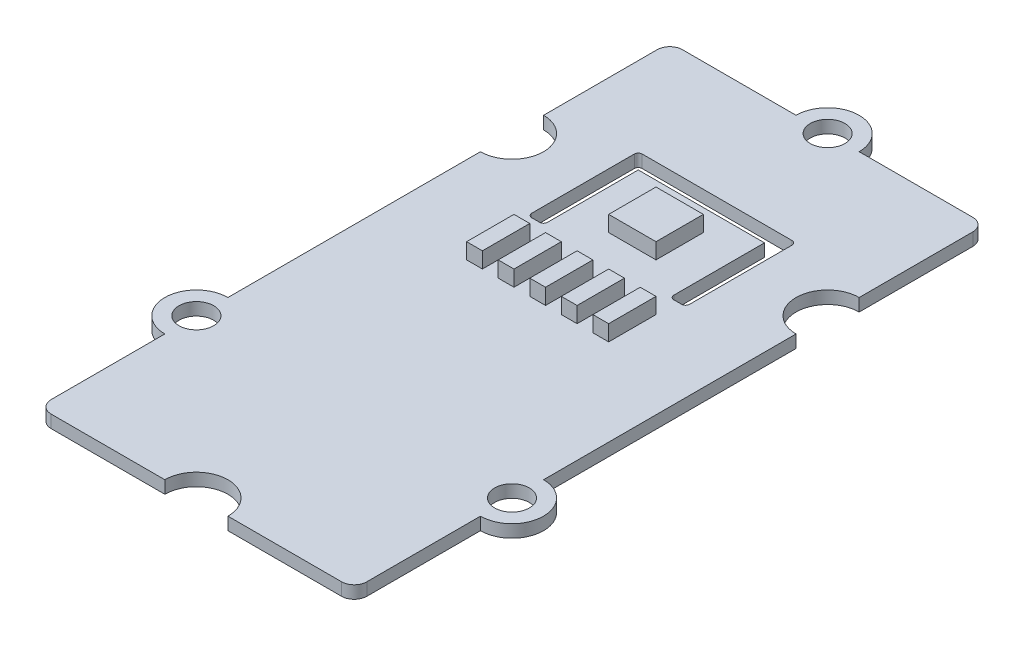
ISO-10303-21;
HEADER;
FILE_DESCRIPTION(('STEP AP214'),'2;1');
FILE_NAME('part.step','',(''),(''),'','','');
FILE_SCHEMA(('AUTOMOTIVE_DESIGN { 1 0 10303 214 1 1 1 1 }'));
ENDSEC;
DATA;
#1=APPLICATION_CONTEXT('core data for automotive mechanical design processes');
#2=APPLICATION_PROTOCOL_DEFINITION('international standard','automotive_design',2000,#1);
#3=PRODUCT_CONTEXT('',#1,'mechanical');
#4=PRODUCT('Part','Part','',(#3));
#5=PRODUCT_RELATED_PRODUCT_CATEGORY('part','',(#4));
#6=PRODUCT_DEFINITION_FORMATION('','',#4);
#7=PRODUCT_DEFINITION_CONTEXT('part definition',#1,'design');
#8=PRODUCT_DEFINITION('design','',#6,#7);
#9=PRODUCT_DEFINITION_SHAPE('','',#8);
#10=(LENGTH_UNIT() NAMED_UNIT(*) SI_UNIT(.MILLI.,.METRE.));
#11=(NAMED_UNIT(*) PLANE_ANGLE_UNIT() SI_UNIT($,.RADIAN.));
#12=(NAMED_UNIT(*) SI_UNIT($,.STERADIAN.) SOLID_ANGLE_UNIT());
#13=UNCERTAINTY_MEASURE_WITH_UNIT(LENGTH_MEASURE(1.E-05),#10,'distance_accuracy_value','');
#14=(GEOMETRIC_REPRESENTATION_CONTEXT(3) GLOBAL_UNCERTAINTY_ASSIGNED_CONTEXT((#13)) GLOBAL_UNIT_ASSIGNED_CONTEXT((#10,
#11,#12)) REPRESENTATION_CONTEXT('',''));
#15=CARTESIAN_POINT('',(0.,0.,0.));
#16=DIRECTION('',(0.,0.,1.));
#17=DIRECTION('',(1.,0.,0.));
#18=AXIS2_PLACEMENT_3D('',#15,#16,#17);
#19=CARTESIAN_POINT('',(0.8,0.8,-0.8));
#20=DIRECTION('',(0.,-1.,0.));
#21=DIRECTION('',(0.,0.,-1.));
#22=AXIS2_PLACEMENT_3D('',#19,#20,#21);
#23=PLANE('',#22);
#24=DIRECTION('',(1.,0.,0.));
#25=VECTOR('',#24,1.);
#26=CARTESIAN_POINT('',(0.,0.8,-30.625));
#27=LINE('',#26,#25);
#28=CARTESIAN_POINT('',(8.5,0.8,-30.625));
#29=VERTEX_POINT('',#28);
#30=CARTESIAN_POINT('',(11.5,0.8,-30.625));
#31=VERTEX_POINT('',#30);
#32=EDGE_CURVE('E54',#29,#31,#27,.T.);
#33=ORIENTED_EDGE('',*,*,#32,.T.);
#34=DIRECTION('',(0.,0.,1.));
#35=VECTOR('',#34,1.);
#36=CARTESIAN_POINT('',(11.5,0.8,0.));
#37=LINE('',#36,#35);
#38=CARTESIAN_POINT('',(11.5,0.8,-27.625));
#39=VERTEX_POINT('',#38);
#40=EDGE_CURVE('E408',#31,#39,#37,.T.);
#41=ORIENTED_EDGE('',*,*,#40,.T.);
#42=DIRECTION('',(1.,0.,0.));
#43=VECTOR('',#42,1.);
#44=CARTESIAN_POINT('',(0.,0.8,-27.625));
#45=LINE('',#44,#43);
#46=CARTESIAN_POINT('',(8.5,0.8,-27.625));
#47=VERTEX_POINT('',#46);
#48=EDGE_CURVE('E421',#47,#39,#45,.T.);
#49=ORIENTED_EDGE('',*,*,#48,.F.);
#50=DIRECTION('',(0.,0.,1.));
#51=VECTOR('',#50,1.);
#52=CARTESIAN_POINT('',(8.5,0.8,0.));
#53=LINE('',#52,#51);
#54=EDGE_CURVE('E59',#29,#47,#53,.T.);
#55=ORIENTED_EDGE('',*,*,#54,.F.);
#56=EDGE_LOOP('',(#33,#41,#49,#55));
#57=FACE_BOUND('',#56,.T.);
#58=DIRECTION('',(0.,0.,1.));
#59=VECTOR('',#58,1.);
#60=CARTESIAN_POINT('',(11.5,0.8,0.));
#61=LINE('',#60,#59);
#62=CARTESIAN_POINT('',(11.5,0.8,-24.625));
#63=VERTEX_POINT('',#62);
#64=CARTESIAN_POINT('',(11.5,0.8,-21.625));
#65=VERTEX_POINT('',#64);
#66=EDGE_CURVE('E472',#63,#65,#61,.T.);
#67=ORIENTED_EDGE('',*,*,#66,.F.);
#68=DIRECTION('',(1.,0.,0.));
#69=VECTOR('',#68,1.);
#70=CARTESIAN_POINT('',(0.,0.8,-24.625));
#71=LINE('',#70,#69);
#72=CARTESIAN_POINT('',(12.5,0.8,-24.625));
#73=VERTEX_POINT('',#72);
#74=EDGE_CURVE('E477',#63,#73,#71,.T.);
#75=ORIENTED_EDGE('',*,*,#74,.T.);
#76=DIRECTION('',(0.,0.,1.));
#77=VECTOR('',#76,1.);
#78=CARTESIAN_POINT('',(12.5,0.8,0.));
#79=LINE('',#78,#77);
#80=CARTESIAN_POINT('',(12.5,0.8,-21.625));
#81=VERTEX_POINT('',#80);
#82=EDGE_CURVE('E491',#73,#81,#79,.T.);
#83=ORIENTED_EDGE('',*,*,#82,.T.);
#84=DIRECTION('',(1.,0.,0.));
#85=VECTOR('',#84,1.);
#86=CARTESIAN_POINT('',(0.,0.8,-21.625));
#87=LINE('',#86,#85);
#88=EDGE_CURVE('E488',#65,#81,#87,.T.);
#89=ORIENTED_EDGE('',*,*,#88,.F.);
#90=EDGE_LOOP('',(#67,#75,#83,#89));
#91=FACE_BOUND('',#90,.T.);
#92=DIRECTION('',(1.,0.,0.));
#93=VECTOR('',#92,1.);
#94=CARTESIAN_POINT('',(0.,0.8,-24.625));
#95=LINE('',#94,#93);
#96=CARTESIAN_POINT('',(9.5,0.8,-24.625));
#97=VERTEX_POINT('',#96);
#98=CARTESIAN_POINT('',(10.5,0.8,-24.625));
#99=VERTEX_POINT('',#98);
#100=EDGE_CURVE('E518',#97,#99,#95,.T.);
#101=ORIENTED_EDGE('',*,*,#100,.T.);
#102=DIRECTION('',(0.,0.,1.));
#103=VECTOR('',#102,1.);
#104=CARTESIAN_POINT('',(10.5,0.8,0.));
#105=LINE('',#104,#103);
#106=CARTESIAN_POINT('',(10.5,0.8,-21.625));
#107=VERTEX_POINT('',#106);
#108=EDGE_CURVE('E504',#99,#107,#105,.T.);
#109=ORIENTED_EDGE('',*,*,#108,.T.);
#110=DIRECTION('',(1.,0.,0.));
#111=VECTOR('',#110,1.);
#112=CARTESIAN_POINT('',(0.,0.8,-21.625));
#113=LINE('',#112,#111);
#114=CARTESIAN_POINT('',(9.5,0.8,-21.625));
#115=VERTEX_POINT('',#114);
#116=EDGE_CURVE('E509',#115,#107,#113,.T.);
#117=ORIENTED_EDGE('',*,*,#116,.F.);
#118=DIRECTION('',(0.,0.,1.));
#119=VECTOR('',#118,1.);
#120=CARTESIAN_POINT('',(9.49999999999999,0.8,0.));
#121=LINE('',#120,#119);
#122=EDGE_CURVE('E520',#97,#115,#121,.T.);
#123=ORIENTED_EDGE('',*,*,#122,.F.);
#124=EDGE_LOOP('',(#101,#109,#117,#123));
#125=FACE_BOUND('',#124,.T.);
#126=DIRECTION('',(0.,0.,1.));
#127=VECTOR('',#126,1.);
#128=CARTESIAN_POINT('',(5.49999999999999,0.8,0.));
#129=LINE('',#128,#127);
#130=CARTESIAN_POINT('',(5.5,0.8,-24.625));
#131=VERTEX_POINT('',#130);
#132=CARTESIAN_POINT('',(5.5,0.8,-21.625));
#133=VERTEX_POINT('',#132);
#134=EDGE_CURVE('E568',#131,#133,#129,.T.);
#135=ORIENTED_EDGE('',*,*,#134,.F.);
#136=DIRECTION('',(1.,0.,0.));
#137=VECTOR('',#136,1.);
#138=CARTESIAN_POINT('',(0.,0.8,-24.625));
#139=LINE('',#138,#137);
#140=CARTESIAN_POINT('',(6.5,0.8,-24.625));
#141=VERTEX_POINT('',#140);
#142=EDGE_CURVE('E573',#131,#141,#139,.T.);
#143=ORIENTED_EDGE('',*,*,#142,.T.);
#144=DIRECTION('',(0.,0.,1.));
#145=VECTOR('',#144,1.);
#146=CARTESIAN_POINT('',(6.50000000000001,0.8,0.));
#147=LINE('',#146,#145);
#148=CARTESIAN_POINT('',(6.5,0.8,-21.625));
#149=VERTEX_POINT('',#148);
#150=EDGE_CURVE('E587',#141,#149,#147,.T.);
#151=ORIENTED_EDGE('',*,*,#150,.T.);
#152=DIRECTION('',(1.,0.,0.));
#153=VECTOR('',#152,1.);
#154=CARTESIAN_POINT('',(0.,0.8,-21.625));
#155=LINE('',#154,#153);
#156=EDGE_CURVE('E584',#133,#149,#155,.T.);
#157=ORIENTED_EDGE('',*,*,#156,.F.);
#158=EDGE_LOOP('',(#135,#143,#151,#157));
#159=FACE_BOUND('',#158,.T.);
#160=CARTESIAN_POINT('',(14.25,0.8,-26.25));
#161=DIRECTION('',(0.,1.,0.));
#162=DIRECTION('',(0.,0.,1.));
#163=AXIS2_PLACEMENT_3D('',#160,#161,#162);
#164=CIRCLE('',#163,0.25);
#165=CARTESIAN_POINT('',(14.,0.8,-26.25));
#166=VERTEX_POINT('',#165);
#167=CARTESIAN_POINT('',(14.25,0.8,-26.));
#168=VERTEX_POINT('',#167);
#169=EDGE_CURVE('E646',#166,#168,#164,.T.);
#170=ORIENTED_EDGE('',*,*,#169,.F.);
#171=DIRECTION('',(0.,0.,-1.));
#172=VECTOR('',#171,1.);
#173=CARTESIAN_POINT('',(14.,0.8,-0.8));
#174=LINE('',#173,#172);
#175=CARTESIAN_POINT('',(14.,0.8,-32.));
#176=VERTEX_POINT('',#175);
#177=EDGE_CURVE('E689',#166,#176,#174,.T.);
#178=ORIENTED_EDGE('',*,*,#177,.T.);
#179=DIRECTION('',(-1.,0.,0.));
#180=VECTOR('',#179,1.);
#181=CARTESIAN_POINT('',(0.8,0.8,-32.));
#182=LINE('',#181,#180);
#183=CARTESIAN_POINT('',(6.,0.8,-32.));
#184=VERTEX_POINT('',#183);
#185=EDGE_CURVE('E686',#176,#184,#182,.T.);
#186=ORIENTED_EDGE('',*,*,#185,.T.);
#187=DIRECTION('',(0.,0.,1.));
#188=VECTOR('',#187,1.);
#189=CARTESIAN_POINT('',(6.,0.8,-0.8));
#190=LINE('',#189,#188);
#191=CARTESIAN_POINT('',(6.,0.8,-26.25));
#192=VERTEX_POINT('',#191);
#193=EDGE_CURVE('E683',#184,#192,#190,.T.);
#194=ORIENTED_EDGE('',*,*,#193,.T.);
#195=CARTESIAN_POINT('',(5.75,0.8,-26.25));
#196=DIRECTION('',(0.,1.,0.));
#197=DIRECTION('',(0.,0.,1.));
#198=AXIS2_PLACEMENT_3D('',#195,#196,#197);
#199=CIRCLE('',#198,0.25);
#200=CARTESIAN_POINT('',(5.75,0.8,-26.));
#201=VERTEX_POINT('',#200);
#202=EDGE_CURVE('E41',#201,#192,#199,.T.);
#203=ORIENTED_EDGE('',*,*,#202,.F.);
#204=DIRECTION('',(1.,0.,0.));
#205=VECTOR('',#204,1.);
#206=CARTESIAN_POINT('',(5.25,0.8,-26.));
#207=LINE('',#206,#205);
#208=CARTESIAN_POINT('',(5.25,0.8,-26.));
#209=VERTEX_POINT('',#208);
#210=EDGE_CURVE('E864',#209,#201,#207,.T.);
#211=ORIENTED_EDGE('',*,*,#210,.F.);
#212=CARTESIAN_POINT('',(5.25,0.8,-26.25));
#213=DIRECTION('',(0.,1.,0.));
#214=DIRECTION('',(0.,0.,1.));
#215=AXIS2_PLACEMENT_3D('',#212,#213,#214);
#216=CIRCLE('',#215,0.25);
#217=CARTESIAN_POINT('',(5.,0.8,-26.25));
#218=VERTEX_POINT('',#217);
#219=EDGE_CURVE('E863',#218,#209,#216,.T.);
#220=ORIENTED_EDGE('',*,*,#219,.F.);
#221=DIRECTION('',(0.,0.,1.));
#222=VECTOR('',#221,1.);
#223=CARTESIAN_POINT('',(5.,0.8,-32.75));
#224=LINE('',#223,#222);
#225=CARTESIAN_POINT('',(5.,0.8,-32.75));
#226=VERTEX_POINT('',#225);
#227=EDGE_CURVE('E861',#226,#218,#224,.T.);
#228=ORIENTED_EDGE('',*,*,#227,.F.);
#229=CARTESIAN_POINT('',(5.25,0.8,-32.75));
#230=DIRECTION('',(0.,1.,0.));
#231=DIRECTION('',(0.,0.,1.));
#232=AXIS2_PLACEMENT_3D('',#229,#230,#231);
#233=CIRCLE('',#232,0.25);
#234=CARTESIAN_POINT('',(5.25,0.8,-33.));
#235=VERTEX_POINT('',#234);
#236=EDGE_CURVE('E859',#235,#226,#233,.T.);
#237=ORIENTED_EDGE('',*,*,#236,.F.);
#238=DIRECTION('',(-1.,0.,0.));
#239=VECTOR('',#238,1.);
#240=CARTESIAN_POINT('',(5.25,0.8,-33.));
#241=LINE('',#240,#239);
#242=CARTESIAN_POINT('',(14.75,0.8,-33.));
#243=VERTEX_POINT('',#242);
#244=EDGE_CURVE('E857',#243,#235,#241,.T.);
#245=ORIENTED_EDGE('',*,*,#244,.F.);
#246=CARTESIAN_POINT('',(14.75,0.8,-32.75));
#247=DIRECTION('',(0.,1.,0.));
#248=DIRECTION('',(0.,0.,1.));
#249=AXIS2_PLACEMENT_3D('',#246,#247,#248);
#250=CIRCLE('',#249,0.25);
#251=CARTESIAN_POINT('',(15.,0.8,-32.75));
#252=VERTEX_POINT('',#251);
#253=EDGE_CURVE('E855',#252,#243,#250,.T.);
#254=ORIENTED_EDGE('',*,*,#253,.F.);
#255=DIRECTION('',(0.,0.,-1.));
#256=VECTOR('',#255,1.);
#257=CARTESIAN_POINT('',(15.,0.8,-32.75));
#258=LINE('',#257,#256);
#259=CARTESIAN_POINT('',(15.,0.8,-26.25));
#260=VERTEX_POINT('',#259);
#261=EDGE_CURVE('E853',#260,#252,#258,.T.);
#262=ORIENTED_EDGE('',*,*,#261,.F.);
#263=CARTESIAN_POINT('',(14.75,0.8,-26.25));
#264=DIRECTION('',(0.,1.,0.));
#265=DIRECTION('',(0.,0.,1.));
#266=AXIS2_PLACEMENT_3D('',#263,#264,#265);
#267=CIRCLE('',#266,0.25);
#268=CARTESIAN_POINT('',(14.75,0.8,-26.));
#269=VERTEX_POINT('',#268);
#270=EDGE_CURVE('E851',#269,#260,#267,.T.);
#271=ORIENTED_EDGE('',*,*,#270,.F.);
#272=DIRECTION('',(1.,0.,0.));
#273=VECTOR('',#272,1.);
#274=CARTESIAN_POINT('',(14.25,0.8,-26.));
#275=LINE('',#274,#273);
#276=EDGE_CURVE('E849',#168,#269,#275,.T.);
#277=ORIENTED_EDGE('',*,*,#276,.F.);
#278=EDGE_LOOP('',(#170,#178,#186,#194,#203,#211,#220,#228,#237,#245,#254,#262,#271,#277));
#279=FACE_BOUND('',#278,.T.);
#280=CARTESIAN_POINT('',(0.8,0.8,-0.8));
#281=DIRECTION('',(0.,1.,0.));
#282=DIRECTION('',(0.,0.,-1.));
#283=AXIS2_PLACEMENT_3D('',#280,#281,#282);
#284=CIRCLE('',#283,0.8);
#285=CARTESIAN_POINT('',(0.,0.8,-0.800000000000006));
#286=VERTEX_POINT('',#285);
#287=CARTESIAN_POINT('',(0.800000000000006,0.8,0.));
#288=VERTEX_POINT('',#287);
#289=EDGE_CURVE('E711',#286,#288,#284,.T.);
#290=ORIENTED_EDGE('',*,*,#289,.T.);
#291=DIRECTION('',(1.,0.,0.));
#292=VECTOR('',#291,1.);
#293=CARTESIAN_POINT('',(0.800000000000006,0.8,0.));
#294=LINE('',#293,#292);
#295=CARTESIAN_POINT('',(8.,0.8,0.));
#296=VERTEX_POINT('',#295);
#297=EDGE_CURVE('E714',#288,#296,#294,.T.);
#298=ORIENTED_EDGE('',*,*,#297,.T.);
#299=CARTESIAN_POINT('',(10.,0.8,0.));
#300=DIRECTION('',(0.,-1.,0.));
#301=DIRECTION('',(0.,0.,1.));
#302=AXIS2_PLACEMENT_3D('',#299,#300,#301);
#303=CIRCLE('',#302,2.);
#304=CARTESIAN_POINT('',(12.,0.8,0.));
#305=VERTEX_POINT('',#304);
#306=EDGE_CURVE('E717',#296,#305,#303,.T.);
#307=ORIENTED_EDGE('',*,*,#306,.T.);
#308=DIRECTION('',(1.,0.,0.));
#309=VECTOR('',#308,1.);
#310=CARTESIAN_POINT('',(12.,0.8,0.));
#311=LINE('',#310,#309);
#312=CARTESIAN_POINT('',(19.2,0.8,0.));
#313=VERTEX_POINT('',#312);
#314=EDGE_CURVE('E719',#305,#313,#311,.T.);
#315=ORIENTED_EDGE('',*,*,#314,.T.);
#316=CARTESIAN_POINT('',(19.2,0.8,-0.8));
#317=DIRECTION('',(0.,1.,0.));
#318=DIRECTION('',(0.,0.,1.));
#319=AXIS2_PLACEMENT_3D('',#316,#317,#318);
#320=CIRCLE('',#319,0.799999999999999);
#321=CARTESIAN_POINT('',(20.,0.8,-0.800000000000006));
#322=VERTEX_POINT('',#321);
#323=EDGE_CURVE('E721',#313,#322,#320,.T.);
#324=ORIENTED_EDGE('',*,*,#323,.T.);
#325=DIRECTION('',(0.,0.,-1.));
#326=VECTOR('',#325,1.);
#327=CARTESIAN_POINT('',(20.,0.8,-0.800000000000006));
#328=LINE('',#327,#326);
#329=CARTESIAN_POINT('',(20.,0.8,-8.));
#330=VERTEX_POINT('',#329);
#331=EDGE_CURVE('E723',#322,#330,#328,.T.);
#332=ORIENTED_EDGE('',*,*,#331,.T.);
#333=CARTESIAN_POINT('',(20.,0.8,-10.));
#334=DIRECTION('',(0.,1.,0.));
#335=DIRECTION('',(0.,0.,1.));
#336=AXIS2_PLACEMENT_3D('',#333,#334,#335);
#337=CIRCLE('',#336,2.);
#338=CARTESIAN_POINT('',(20.,0.8,-12.));
#339=VERTEX_POINT('',#338);
#340=EDGE_CURVE('E725',#330,#339,#337,.T.);
#341=ORIENTED_EDGE('',*,*,#340,.T.);
#342=DIRECTION('',(0.,0.,-1.));
#343=VECTOR('',#342,1.);
#344=CARTESIAN_POINT('',(20.,0.8,-12.));
#345=LINE('',#344,#343);
#346=CARTESIAN_POINT('',(20.,0.8,-28.));
#347=VERTEX_POINT('',#346);
#348=EDGE_CURVE('E727',#339,#347,#345,.T.);
#349=ORIENTED_EDGE('',*,*,#348,.T.);
#350=CARTESIAN_POINT('',(20.,0.8,-30.));
#351=DIRECTION('',(0.,-1.,0.));
#352=DIRECTION('',(0.,0.,1.));
#353=AXIS2_PLACEMENT_3D('',#350,#351,#352);
#354=CIRCLE('',#353,2.);
#355=CARTESIAN_POINT('',(20.,0.8,-32.));
#356=VERTEX_POINT('',#355);
#357=EDGE_CURVE('E729',#347,#356,#354,.T.);
#358=ORIENTED_EDGE('',*,*,#357,.T.);
#359=DIRECTION('',(0.,0.,-1.));
#360=VECTOR('',#359,1.);
#361=CARTESIAN_POINT('',(20.,0.8,-32.));
#362=LINE('',#361,#360);
#363=CARTESIAN_POINT('',(20.,0.8,-39.2));
#364=VERTEX_POINT('',#363);
#365=EDGE_CURVE('E731',#356,#364,#362,.T.);
#366=ORIENTED_EDGE('',*,*,#365,.T.);
#367=CARTESIAN_POINT('',(19.2,0.8,-39.2));
#368=DIRECTION('',(0.,1.,0.));
#369=DIRECTION('',(0.,0.,-1.));
#370=AXIS2_PLACEMENT_3D('',#367,#368,#369);
#371=CIRCLE('',#370,0.8);
#372=CARTESIAN_POINT('',(19.2,0.8,-40.));
#373=VERTEX_POINT('',#372);
#374=EDGE_CURVE('E733',#364,#373,#371,.T.);
#375=ORIENTED_EDGE('',*,*,#374,.T.);
#376=DIRECTION('',(-1.,0.,0.));
#377=VECTOR('',#376,1.);
#378=CARTESIAN_POINT('',(12.,0.8,-40.));
#379=LINE('',#378,#377);
#380=CARTESIAN_POINT('',(12.,0.8,-40.));
#381=VERTEX_POINT('',#380);
#382=EDGE_CURVE('E735',#373,#381,#379,.T.);
#383=ORIENTED_EDGE('',*,*,#382,.T.);
#384=CARTESIAN_POINT('',(10.,0.8,-40.));
#385=DIRECTION('',(0.,1.,0.));
#386=DIRECTION('',(0.,0.,1.));
#387=AXIS2_PLACEMENT_3D('',#384,#385,#386);
#388=CIRCLE('',#387,2.);
#389=CARTESIAN_POINT('',(8.,0.8,-40.));
#390=VERTEX_POINT('',#389);
#391=EDGE_CURVE('E737',#381,#390,#388,.T.);
#392=ORIENTED_EDGE('',*,*,#391,.T.);
#393=DIRECTION('',(-1.,0.,0.));
#394=VECTOR('',#393,1.);
#395=CARTESIAN_POINT('',(0.800000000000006,0.8,-40.));
#396=LINE('',#395,#394);
#397=CARTESIAN_POINT('',(0.800000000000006,0.8,-40.));
#398=VERTEX_POINT('',#397);
#399=EDGE_CURVE('E739',#390,#398,#396,.T.);
#400=ORIENTED_EDGE('',*,*,#399,.T.);
#401=CARTESIAN_POINT('',(0.8,0.8,-39.2));
#402=DIRECTION('',(0.,1.,0.));
#403=DIRECTION('',(0.,0.,-1.));
#404=AXIS2_PLACEMENT_3D('',#401,#402,#403);
#405=CIRCLE('',#404,0.800000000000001);
#406=CARTESIAN_POINT('',(0.,0.8,-39.2));
#407=VERTEX_POINT('',#406);
#408=EDGE_CURVE('E741',#398,#407,#405,.T.);
#409=ORIENTED_EDGE('',*,*,#408,.T.);
#410=DIRECTION('',(0.,0.,1.));
#411=VECTOR('',#410,1.);
#412=CARTESIAN_POINT('',(0.,0.8,-32.));
#413=LINE('',#412,#411);
#414=CARTESIAN_POINT('',(0.,0.8,-32.));
#415=VERTEX_POINT('',#414);
#416=EDGE_CURVE('E743',#407,#415,#413,.T.);
#417=ORIENTED_EDGE('',*,*,#416,.T.);
#418=CARTESIAN_POINT('',(0.,0.8,-30.));
#419=DIRECTION('',(0.,-1.,0.));
#420=DIRECTION('',(0.,0.,1.));
#421=AXIS2_PLACEMENT_3D('',#418,#419,#420);
#422=CIRCLE('',#421,2.);
#423=CARTESIAN_POINT('',(0.,0.8,-28.));
#424=VERTEX_POINT('',#423);
#425=EDGE_CURVE('E745',#415,#424,#422,.T.);
#426=ORIENTED_EDGE('',*,*,#425,.T.);
#427=DIRECTION('',(0.,0.,1.));
#428=VECTOR('',#427,1.);
#429=CARTESIAN_POINT('',(0.,0.8,-12.));
#430=LINE('',#429,#428);
#431=CARTESIAN_POINT('',(0.,0.8,-12.));
#432=VERTEX_POINT('',#431);
#433=EDGE_CURVE('E747',#424,#432,#430,.T.);
#434=ORIENTED_EDGE('',*,*,#433,.T.);
#435=CARTESIAN_POINT('',(0.,0.8,-10.));
#436=DIRECTION('',(0.,1.,0.));
#437=DIRECTION('',(0.,0.,1.));
#438=AXIS2_PLACEMENT_3D('',#435,#436,#437);
#439=CIRCLE('',#438,2.);
#440=CARTESIAN_POINT('',(0.,0.8,-8.));
#441=VERTEX_POINT('',#440);
#442=EDGE_CURVE('E749',#432,#441,#439,.T.);
#443=ORIENTED_EDGE('',*,*,#442,.T.);
#444=DIRECTION('',(0.,0.,1.));
#445=VECTOR('',#444,1.);
#446=CARTESIAN_POINT('',(0.,0.8,-0.800000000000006));
#447=LINE('',#446,#445);
#448=EDGE_CURVE('E751',#441,#286,#447,.T.);
#449=ORIENTED_EDGE('',*,*,#448,.T.);
#450=EDGE_LOOP('',(#290,#298,#307,#315,#324,#332,#341,#349,#358,#366,#375,#383,#392,#400,#409,
#417,#426,#434,#443,#449));
#451=FACE_BOUND('',#450,.T.);
#452=CARTESIAN_POINT('',(10.,0.8,-40.));
#453=DIRECTION('',(0.,1.,0.));
#454=DIRECTION('',(0.,0.,1.));
#455=AXIS2_PLACEMENT_3D('',#452,#453,#454);
#456=CIRCLE('',#455,1.1);
#457=CARTESIAN_POINT('',(10.,0.8,-38.9));
#458=VERTEX_POINT('',#457);
#459=EDGE_CURVE('E705',#458,#458,#456,.T.);
#460=ORIENTED_EDGE('',*,*,#459,.F.);
#461=EDGE_LOOP('',(#460));
#462=FACE_BOUND('',#461,.T.);
#463=CARTESIAN_POINT('',(20.,0.8,-10.));
#464=DIRECTION('',(0.,1.,0.));
#465=DIRECTION('',(0.,0.,1.));
#466=AXIS2_PLACEMENT_3D('',#463,#464,#465);
#467=CIRCLE('',#466,1.1);
#468=CARTESIAN_POINT('',(20.,0.8,-8.9));
#469=VERTEX_POINT('',#468);
#470=EDGE_CURVE('E699',#469,#469,#467,.T.);
#471=ORIENTED_EDGE('',*,*,#470,.F.);
#472=EDGE_LOOP('',(#471));
#473=FACE_BOUND('',#472,.T.);
#474=CARTESIAN_POINT('',(0.,0.8,-10.));
#475=DIRECTION('',(0.,1.,0.));
#476=DIRECTION('',(0.,0.,1.));
#477=AXIS2_PLACEMENT_3D('',#474,#475,#476);
#478=CIRCLE('',#477,1.1);
#479=CARTESIAN_POINT('',(0.,0.8,-8.9));
#480=VERTEX_POINT('',#479);
#481=EDGE_CURVE('E693',#480,#480,#478,.T.);
#482=ORIENTED_EDGE('',*,*,#481,.F.);
#483=EDGE_LOOP('',(#482));
#484=FACE_BOUND('',#483,.T.);
#485=DIRECTION('',(0.,0.,1.));
#486=VECTOR('',#485,1.);
#487=CARTESIAN_POINT('',(7.49999999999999,0.8,0.));
#488=LINE('',#487,#486);
#489=CARTESIAN_POINT('',(7.5,0.8,-24.625));
#490=VERTEX_POINT('',#489);
#491=CARTESIAN_POINT('',(7.5,0.8,-21.625));
#492=VERTEX_POINT('',#491);
#493=EDGE_CURVE('E536',#490,#492,#488,.T.);
#494=ORIENTED_EDGE('',*,*,#493,.F.);
#495=DIRECTION('',(1.,0.,0.));
#496=VECTOR('',#495,1.);
#497=CARTESIAN_POINT('',(0.,0.8,-24.625));
#498=LINE('',#497,#496);
#499=CARTESIAN_POINT('',(8.5,0.8,-24.625));
#500=VERTEX_POINT('',#499);
#501=EDGE_CURVE('E541',#490,#500,#498,.T.);
#502=ORIENTED_EDGE('',*,*,#501,.T.);
#503=DIRECTION('',(0.,0.,1.));
#504=VECTOR('',#503,1.);
#505=CARTESIAN_POINT('',(8.50000000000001,0.8,0.));
#506=LINE('',#505,#504);
#507=CARTESIAN_POINT('',(8.5,0.8,-21.625));
#508=VERTEX_POINT('',#507);
#509=EDGE_CURVE('E555',#500,#508,#506,.T.);
#510=ORIENTED_EDGE('',*,*,#509,.T.);
#511=DIRECTION('',(1.,0.,0.));
#512=VECTOR('',#511,1.);
#513=CARTESIAN_POINT('',(0.,0.8,-21.625));
#514=LINE('',#513,#512);
#515=EDGE_CURVE('E552',#492,#508,#514,.T.);
#516=ORIENTED_EDGE('',*,*,#515,.F.);
#517=EDGE_LOOP('',(#494,#502,#510,#516));
#518=FACE_BOUND('',#517,.T.);
#519=DIRECTION('',(0.,0.,1.));
#520=VECTOR('',#519,1.);
#521=CARTESIAN_POINT('',(13.5,0.8,0.));
#522=LINE('',#521,#520);
#523=CARTESIAN_POINT('',(13.5,0.8,-24.625));
#524=VERTEX_POINT('',#523);
#525=CARTESIAN_POINT('',(13.5,0.8,-21.625));
#526=VERTEX_POINT('',#525);
#527=EDGE_CURVE('E411',#524,#526,#522,.T.);
#528=ORIENTED_EDGE('',*,*,#527,.F.);
#529=DIRECTION('',(1.,0.,0.));
#530=VECTOR('',#529,1.);
#531=CARTESIAN_POINT('',(0.,0.8,-24.625));
#532=LINE('',#531,#530);
#533=CARTESIAN_POINT('',(14.5,0.8,-24.625));
#534=VERTEX_POINT('',#533);
#535=EDGE_CURVE('E445',#524,#534,#532,.T.);
#536=ORIENTED_EDGE('',*,*,#535,.T.);
#537=DIRECTION('',(0.,0.,1.));
#538=VECTOR('',#537,1.);
#539=CARTESIAN_POINT('',(14.5,0.8,0.));
#540=LINE('',#539,#538);
#541=CARTESIAN_POINT('',(14.5,0.8,-21.625));
#542=VERTEX_POINT('',#541);
#543=EDGE_CURVE('E459',#534,#542,#540,.T.);
#544=ORIENTED_EDGE('',*,*,#543,.T.);
#545=DIRECTION('',(1.,0.,0.));
#546=VECTOR('',#545,1.);
#547=CARTESIAN_POINT('',(0.,0.8,-21.625));
#548=LINE('',#547,#546);
#549=EDGE_CURVE('E456',#526,#542,#548,.T.);
#550=ORIENTED_EDGE('',*,*,#549,.F.);
#551=EDGE_LOOP('',(#528,#536,#544,#550));
#552=FACE_BOUND('',#551,.T.);
#553=ADVANCED_FACE('F37',(#57,#91,#125,#159,#279,#451,#462,#473,#484,#518,#552),#23,.F.);
#554=CARTESIAN_POINT('',(0.8,0.,-0.8));
#555=DIRECTION('',(0.,-1.,0.));
#556=DIRECTION('',(0.,0.,-1.));
#557=AXIS2_PLACEMENT_3D('',#554,#555,#556);
#558=PLANE('',#557);
#559=DIRECTION('',(0.,0.,1.));
#560=VECTOR('',#559,1.);
#561=CARTESIAN_POINT('',(14.,0.,-26.25));
#562=LINE('',#561,#560);
#563=CARTESIAN_POINT('',(14.,0.,-32.));
#564=VERTEX_POINT('',#563);
#565=CARTESIAN_POINT('',(14.,0.,-26.25));
#566=VERTEX_POINT('',#565);
#567=EDGE_CURVE('E600',#564,#566,#562,.T.);
#568=ORIENTED_EDGE('',*,*,#567,.T.);
#569=CARTESIAN_POINT('',(14.25,0.,-26.25));
#570=DIRECTION('',(0.,1.,0.));
#571=DIRECTION('',(0.,0.,-1.));
#572=AXIS2_PLACEMENT_3D('',#569,#570,#571);
#573=CIRCLE('',#572,0.25);
#574=CARTESIAN_POINT('',(14.25,0.,-26.));
#575=VERTEX_POINT('',#574);
#576=EDGE_CURVE('E603',#566,#575,#573,.T.);
#577=ORIENTED_EDGE('',*,*,#576,.T.);
#578=DIRECTION('',(1.,0.,0.));
#579=VECTOR('',#578,1.);
#580=CARTESIAN_POINT('',(14.25,0.,-26.));
#581=LINE('',#580,#579);
#582=CARTESIAN_POINT('',(14.75,0.,-26.));
#583=VERTEX_POINT('',#582);
#584=EDGE_CURVE('E606',#575,#583,#581,.T.);
#585=ORIENTED_EDGE('',*,*,#584,.T.);
#586=CARTESIAN_POINT('',(14.75,0.,-26.25));
#587=DIRECTION('',(0.,1.,0.));
#588=DIRECTION('',(0.,0.,1.));
#589=AXIS2_PLACEMENT_3D('',#586,#587,#588);
#590=CIRCLE('',#589,0.25);
#591=CARTESIAN_POINT('',(15.,0.,-26.25));
#592=VERTEX_POINT('',#591);
#593=EDGE_CURVE('E609',#583,#592,#590,.T.);
#594=ORIENTED_EDGE('',*,*,#593,.T.);
#595=DIRECTION('',(0.,0.,-1.));
#596=VECTOR('',#595,1.);
#597=CARTESIAN_POINT('',(15.,0.,-32.75));
#598=LINE('',#597,#596);
#599=CARTESIAN_POINT('',(15.,0.,-32.75));
#600=VERTEX_POINT('',#599);
#601=EDGE_CURVE('E612',#592,#600,#598,.T.);
#602=ORIENTED_EDGE('',*,*,#601,.T.);
#603=CARTESIAN_POINT('',(14.75,0.,-32.75));
#604=DIRECTION('',(0.,1.,0.));
#605=DIRECTION('',(0.,0.,-1.));
#606=AXIS2_PLACEMENT_3D('',#603,#604,#605);
#607=CIRCLE('',#606,0.25);
#608=CARTESIAN_POINT('',(14.75,0.,-33.));
#609=VERTEX_POINT('',#608);
#610=EDGE_CURVE('E615',#600,#609,#607,.T.);
#611=ORIENTED_EDGE('',*,*,#610,.T.);
#612=DIRECTION('',(-1.,0.,0.));
#613=VECTOR('',#612,1.);
#614=CARTESIAN_POINT('',(5.25,0.,-33.));
#615=LINE('',#614,#613);
#616=CARTESIAN_POINT('',(5.25,0.,-33.));
#617=VERTEX_POINT('',#616);
#618=EDGE_CURVE('E618',#609,#617,#615,.T.);
#619=ORIENTED_EDGE('',*,*,#618,.T.);
#620=CARTESIAN_POINT('',(5.25,0.,-32.75));
#621=DIRECTION('',(0.,1.,0.));
#622=DIRECTION('',(0.,0.,1.));
#623=AXIS2_PLACEMENT_3D('',#620,#621,#622);
#624=CIRCLE('',#623,0.25);
#625=CARTESIAN_POINT('',(5.,0.,-32.75));
#626=VERTEX_POINT('',#625);
#627=EDGE_CURVE('E621',#617,#626,#624,.T.);
#628=ORIENTED_EDGE('',*,*,#627,.T.);
#629=DIRECTION('',(0.,0.,1.));
#630=VECTOR('',#629,1.);
#631=CARTESIAN_POINT('',(5.,0.,-32.75));
#632=LINE('',#631,#630);
#633=CARTESIAN_POINT('',(5.,0.,-26.25));
#634=VERTEX_POINT('',#633);
#635=EDGE_CURVE('E624',#626,#634,#632,.T.);
#636=ORIENTED_EDGE('',*,*,#635,.T.);
#637=CARTESIAN_POINT('',(5.25,0.,-26.25));
#638=DIRECTION('',(0.,1.,0.));
#639=DIRECTION('',(0.,0.,1.));
#640=AXIS2_PLACEMENT_3D('',#637,#638,#639);
#641=CIRCLE('',#640,0.25);
#642=CARTESIAN_POINT('',(5.25,0.,-26.));
#643=VERTEX_POINT('',#642);
#644=EDGE_CURVE('E627',#634,#643,#641,.T.);
#645=ORIENTED_EDGE('',*,*,#644,.T.);
#646=DIRECTION('',(1.,0.,0.));
#647=VECTOR('',#646,1.);
#648=CARTESIAN_POINT('',(5.25,0.,-26.));
#649=LINE('',#648,#647);
#650=CARTESIAN_POINT('',(5.75,0.,-26.));
#651=VERTEX_POINT('',#650);
#652=EDGE_CURVE('E630',#643,#651,#649,.T.);
#653=ORIENTED_EDGE('',*,*,#652,.T.);
#654=CARTESIAN_POINT('',(5.75,0.,-26.25));
#655=DIRECTION('',(0.,1.,0.));
#656=DIRECTION('',(0.,0.,1.));
#657=AXIS2_PLACEMENT_3D('',#654,#655,#656);
#658=CIRCLE('',#657,0.25);
#659=CARTESIAN_POINT('',(6.,0.,-26.25));
#660=VERTEX_POINT('',#659);
#661=EDGE_CURVE('E633',#651,#660,#658,.T.);
#662=ORIENTED_EDGE('',*,*,#661,.T.);
#663=DIRECTION('',(0.,0.,-1.));
#664=VECTOR('',#663,1.);
#665=CARTESIAN_POINT('',(6.,0.,-26.25));
#666=LINE('',#665,#664);
#667=CARTESIAN_POINT('',(6.,0.,-32.));
#668=VERTEX_POINT('',#667);
#669=EDGE_CURVE('E636',#660,#668,#666,.T.);
#670=ORIENTED_EDGE('',*,*,#669,.T.);
#671=DIRECTION('',(1.,0.,0.));
#672=VECTOR('',#671,1.);
#673=CARTESIAN_POINT('',(6.,0.,-32.));
#674=LINE('',#673,#672);
#675=EDGE_CURVE('E639',#668,#564,#674,.T.);
#676=ORIENTED_EDGE('',*,*,#675,.T.);
#677=EDGE_LOOP('',(#568,#577,#585,#594,#602,#611,#619,#628,#636,#645,#653,#662,#670,#676));
#678=FACE_BOUND('',#677,.T.);
#679=CARTESIAN_POINT('',(20.,0.,-10.));
#680=DIRECTION('',(0.,1.,0.));
#681=DIRECTION('',(0.,0.,1.));
#682=AXIS2_PLACEMENT_3D('',#679,#680,#681);
#683=CIRCLE('',#682,1.1);
#684=CARTESIAN_POINT('',(20.,0.,-8.9));
#685=VERTEX_POINT('',#684);
#686=EDGE_CURVE('E696',#685,#685,#683,.T.);
#687=ORIENTED_EDGE('',*,*,#686,.T.);
#688=EDGE_LOOP('',(#687));
#689=FACE_BOUND('',#688,.T.);
#690=CARTESIAN_POINT('',(0.8,0.,-0.8));
#691=DIRECTION('',(0.,1.,0.));
#692=DIRECTION('',(0.,0.,-1.));
#693=AXIS2_PLACEMENT_3D('',#690,#691,#692);
#694=CIRCLE('',#693,0.8);
#695=CARTESIAN_POINT('',(0.,0.,-0.800000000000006));
#696=VERTEX_POINT('',#695);
#697=CARTESIAN_POINT('',(0.800000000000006,0.,0.));
#698=VERTEX_POINT('',#697);
#699=EDGE_CURVE('E708',#696,#698,#694,.T.);
#700=ORIENTED_EDGE('',*,*,#699,.F.);
#701=DIRECTION('',(0.,0.,1.));
#702=VECTOR('',#701,1.);
#703=CARTESIAN_POINT('',(0.,0.,-0.800000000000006));
#704=LINE('',#703,#702);
#705=CARTESIAN_POINT('',(0.,0.,-8.));
#706=VERTEX_POINT('',#705);
#707=EDGE_CURVE('E715',#706,#696,#704,.T.);
#708=ORIENTED_EDGE('',*,*,#707,.F.);
#709=CARTESIAN_POINT('',(0.,0.,-10.));
#710=DIRECTION('',(0.,1.,0.));
#711=DIRECTION('',(0.,0.,1.));
#712=AXIS2_PLACEMENT_3D('',#709,#710,#711);
#713=CIRCLE('',#712,2.);
#714=CARTESIAN_POINT('',(0.,0.,-12.));
#715=VERTEX_POINT('',#714);
#716=EDGE_CURVE('E790',#715,#706,#713,.T.);
#717=ORIENTED_EDGE('',*,*,#716,.F.);
#718=DIRECTION('',(0.,0.,1.));
#719=VECTOR('',#718,1.);
#720=CARTESIAN_POINT('',(0.,0.,-12.));
#721=LINE('',#720,#719);
#722=CARTESIAN_POINT('',(0.,0.,-28.));
#723=VERTEX_POINT('',#722);
#724=EDGE_CURVE('E788',#723,#715,#721,.T.);
#725=ORIENTED_EDGE('',*,*,#724,.F.);
#726=CARTESIAN_POINT('',(0.,0.,-30.));
#727=DIRECTION('',(0.,-1.,0.));
#728=DIRECTION('',(0.,0.,1.));
#729=AXIS2_PLACEMENT_3D('',#726,#727,#728);
#730=CIRCLE('',#729,2.);
#731=CARTESIAN_POINT('',(0.,0.,-32.));
#732=VERTEX_POINT('',#731);
#733=EDGE_CURVE('E786',#732,#723,#730,.T.);
#734=ORIENTED_EDGE('',*,*,#733,.F.);
#735=DIRECTION('',(0.,0.,1.));
#736=VECTOR('',#735,1.);
#737=CARTESIAN_POINT('',(0.,0.,-32.));
#738=LINE('',#737,#736);
#739=CARTESIAN_POINT('',(0.,0.,-39.2));
#740=VERTEX_POINT('',#739);
#741=EDGE_CURVE('E784',#740,#732,#738,.T.);
#742=ORIENTED_EDGE('',*,*,#741,.F.);
#743=CARTESIAN_POINT('',(0.8,0.,-39.2));
#744=DIRECTION('',(0.,1.,0.));
#745=DIRECTION('',(0.,0.,-1.));
#746=AXIS2_PLACEMENT_3D('',#743,#744,#745);
#747=CIRCLE('',#746,0.800000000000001);
#748=CARTESIAN_POINT('',(0.800000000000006,0.,-40.));
#749=VERTEX_POINT('',#748);
#750=EDGE_CURVE('E782',#749,#740,#747,.T.);
#751=ORIENTED_EDGE('',*,*,#750,.F.);
#752=DIRECTION('',(-1.,0.,0.));
#753=VECTOR('',#752,1.);
#754=CARTESIAN_POINT('',(0.800000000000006,0.,-40.));
#755=LINE('',#754,#753);
#756=CARTESIAN_POINT('',(8.,0.,-40.));
#757=VERTEX_POINT('',#756);
#758=EDGE_CURVE('E780',#757,#749,#755,.T.);
#759=ORIENTED_EDGE('',*,*,#758,.F.);
#760=CARTESIAN_POINT('',(10.,0.,-40.));
#761=DIRECTION('',(0.,1.,0.));
#762=DIRECTION('',(0.,0.,1.));
#763=AXIS2_PLACEMENT_3D('',#760,#761,#762);
#764=CIRCLE('',#763,2.);
#765=CARTESIAN_POINT('',(12.,0.,-40.));
#766=VERTEX_POINT('',#765);
#767=EDGE_CURVE('E778',#766,#757,#764,.T.);
#768=ORIENTED_EDGE('',*,*,#767,.F.);
#769=DIRECTION('',(-1.,0.,0.));
#770=VECTOR('',#769,1.);
#771=CARTESIAN_POINT('',(12.,0.,-40.));
#772=LINE('',#771,#770);
#773=CARTESIAN_POINT('',(19.2,0.,-40.));
#774=VERTEX_POINT('',#773);
#775=EDGE_CURVE('E776',#774,#766,#772,.T.);
#776=ORIENTED_EDGE('',*,*,#775,.F.);
#777=CARTESIAN_POINT('',(19.2,0.,-39.2));
#778=DIRECTION('',(0.,1.,0.));
#779=DIRECTION('',(0.,0.,-1.));
#780=AXIS2_PLACEMENT_3D('',#777,#778,#779);
#781=CIRCLE('',#780,0.8);
#782=CARTESIAN_POINT('',(20.,0.,-39.2));
#783=VERTEX_POINT('',#782);
#784=EDGE_CURVE('E774',#783,#774,#781,.T.);
#785=ORIENTED_EDGE('',*,*,#784,.F.);
#786=DIRECTION('',(0.,0.,-1.));
#787=VECTOR('',#786,1.);
#788=CARTESIAN_POINT('',(20.,0.,-32.));
#789=LINE('',#788,#787);
#790=CARTESIAN_POINT('',(20.,0.,-32.));
#791=VERTEX_POINT('',#790);
#792=EDGE_CURVE('E772',#791,#783,#789,.T.);
#793=ORIENTED_EDGE('',*,*,#792,.F.);
#794=CARTESIAN_POINT('',(20.,0.,-30.));
#795=DIRECTION('',(0.,-1.,0.));
#796=DIRECTION('',(0.,0.,1.));
#797=AXIS2_PLACEMENT_3D('',#794,#795,#796);
#798=CIRCLE('',#797,2.);
#799=CARTESIAN_POINT('',(20.,0.,-28.));
#800=VERTEX_POINT('',#799);
#801=EDGE_CURVE('E770',#800,#791,#798,.T.);
#802=ORIENTED_EDGE('',*,*,#801,.F.);
#803=DIRECTION('',(0.,0.,-1.));
#804=VECTOR('',#803,1.);
#805=CARTESIAN_POINT('',(20.,0.,-12.));
#806=LINE('',#805,#804);
#807=CARTESIAN_POINT('',(20.,0.,-12.));
#808=VERTEX_POINT('',#807);
#809=EDGE_CURVE('E768',#808,#800,#806,.T.);
#810=ORIENTED_EDGE('',*,*,#809,.F.);
#811=CARTESIAN_POINT('',(20.,0.,-10.));
#812=DIRECTION('',(0.,1.,0.));
#813=DIRECTION('',(0.,0.,1.));
#814=AXIS2_PLACEMENT_3D('',#811,#812,#813);
#815=CIRCLE('',#814,2.);
#816=CARTESIAN_POINT('',(20.,0.,-8.));
#817=VERTEX_POINT('',#816);
#818=EDGE_CURVE('E766',#817,#808,#815,.T.);
#819=ORIENTED_EDGE('',*,*,#818,.F.);
#820=DIRECTION('',(0.,0.,-1.));
#821=VECTOR('',#820,1.);
#822=CARTESIAN_POINT('',(20.,0.,-0.800000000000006));
#823=LINE('',#822,#821);
#824=CARTESIAN_POINT('',(20.,0.,-0.800000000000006));
#825=VERTEX_POINT('',#824);
#826=EDGE_CURVE('E764',#825,#817,#823,.T.);
#827=ORIENTED_EDGE('',*,*,#826,.F.);
#828=CARTESIAN_POINT('',(19.2,0.,-0.8));
#829=DIRECTION('',(0.,1.,0.));
#830=DIRECTION('',(0.,0.,1.));
#831=AXIS2_PLACEMENT_3D('',#828,#829,#830);
#832=CIRCLE('',#831,0.799999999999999);
#833=CARTESIAN_POINT('',(19.2,0.,0.));
#834=VERTEX_POINT('',#833);
#835=EDGE_CURVE('E762',#834,#825,#832,.T.);
#836=ORIENTED_EDGE('',*,*,#835,.F.);
#837=DIRECTION('',(1.,0.,0.));
#838=VECTOR('',#837,1.);
#839=CARTESIAN_POINT('',(12.,0.,0.));
#840=LINE('',#839,#838);
#841=CARTESIAN_POINT('',(12.,0.,0.));
#842=VERTEX_POINT('',#841);
#843=EDGE_CURVE('E760',#842,#834,#840,.T.);
#844=ORIENTED_EDGE('',*,*,#843,.F.);
#845=CARTESIAN_POINT('',(10.,0.,0.));
#846=DIRECTION('',(0.,-1.,0.));
#847=DIRECTION('',(0.,0.,1.));
#848=AXIS2_PLACEMENT_3D('',#845,#846,#847);
#849=CIRCLE('',#848,2.);
#850=CARTESIAN_POINT('',(8.,0.,0.));
#851=VERTEX_POINT('',#850);
#852=EDGE_CURVE('E758',#851,#842,#849,.T.);
#853=ORIENTED_EDGE('',*,*,#852,.F.);
#854=DIRECTION('',(1.,0.,0.));
#855=VECTOR('',#854,1.);
#856=CARTESIAN_POINT('',(0.800000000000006,0.,0.));
#857=LINE('',#856,#855);
#858=EDGE_CURVE('E756',#698,#851,#857,.T.);
#859=ORIENTED_EDGE('',*,*,#858,.F.);
#860=EDGE_LOOP('',(#700,#708,#717,#725,#734,#742,#751,#759,#768,#776,#785,#793,#802,#810,#819,
#827,#836,#844,#853,#859));
#861=FACE_BOUND('',#860,.T.);
#862=CARTESIAN_POINT('',(10.,0.,-40.));
#863=DIRECTION('',(0.,1.,0.));
#864=DIRECTION('',(0.,0.,1.));
#865=AXIS2_PLACEMENT_3D('',#862,#863,#864);
#866=CIRCLE('',#865,1.1);
#867=CARTESIAN_POINT('',(10.,0.,-38.9));
#868=VERTEX_POINT('',#867);
#869=EDGE_CURVE('E702',#868,#868,#866,.T.);
#870=ORIENTED_EDGE('',*,*,#869,.T.);
#871=EDGE_LOOP('',(#870));
#872=FACE_BOUND('',#871,.T.);
#873=CARTESIAN_POINT('',(0.,0.,-10.));
#874=DIRECTION('',(0.,1.,0.));
#875=DIRECTION('',(0.,0.,1.));
#876=AXIS2_PLACEMENT_3D('',#873,#874,#875);
#877=CIRCLE('',#876,1.1);
#878=CARTESIAN_POINT('',(0.,0.,-8.9));
#879=VERTEX_POINT('',#878);
#880=EDGE_CURVE('E692',#879,#879,#877,.T.);
#881=ORIENTED_EDGE('',*,*,#880,.T.);
#882=EDGE_LOOP('',(#881));
#883=FACE_BOUND('',#882,.T.);
#884=ADVANCED_FACE('F883',(#678,#689,#861,#872,#883),#558,.T.);
#885=CARTESIAN_POINT('',(0.8,0.8,-0.8));
#886=DIRECTION('',(0.,-1.,0.));
#887=DIRECTION('',(0.,0.,-1.));
#888=AXIS2_PLACEMENT_3D('',#885,#886,#887);
#889=CYLINDRICAL_SURFACE('',#888,0.8);
#890=ORIENTED_EDGE('',*,*,#699,.T.);
#891=DIRECTION('',(0.,-1.,0.));
#892=VECTOR('',#891,1.);
#893=CARTESIAN_POINT('',(0.800000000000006,0.8,0.));
#894=LINE('',#893,#892);
#895=EDGE_CURVE('E11',#288,#698,#894,.T.);
#896=ORIENTED_EDGE('',*,*,#895,.F.);
#897=ORIENTED_EDGE('',*,*,#289,.F.);
#898=DIRECTION('',(0.,-1.,0.));
#899=VECTOR('',#898,1.);
#900=CARTESIAN_POINT('',(0.,0.8,-0.800000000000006));
#901=LINE('',#900,#899);
#902=EDGE_CURVE('E753',#286,#696,#901,.T.);
#903=ORIENTED_EDGE('',*,*,#902,.T.);
#904=EDGE_LOOP('',(#890,#896,#897,#903));
#905=FACE_BOUND('',#904,.T.);
#906=ADVANCED_FACE('F39',(#905),#889,.T.);
#907=CARTESIAN_POINT('',(0.800000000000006,0.8,0.));
#908=DIRECTION('',(0.,0.,-1.));
#909=DIRECTION('',(-1.,0.,0.));
#910=AXIS2_PLACEMENT_3D('',#907,#908,#909);
#911=PLANE('',#910);
#912=ORIENTED_EDGE('',*,*,#858,.T.);
#913=DIRECTION('',(0.,-1.,0.));
#914=VECTOR('',#913,1.);
#915=CARTESIAN_POINT('',(8.,0.8,0.));
#916=LINE('',#915,#914);
#917=EDGE_CURVE('E46',#296,#851,#916,.T.);
#918=ORIENTED_EDGE('',*,*,#917,.F.);
#919=ORIENTED_EDGE('',*,*,#297,.F.);
#920=ORIENTED_EDGE('',*,*,#895,.T.);
#921=EDGE_LOOP('',(#912,#918,#919,#920));
#922=FACE_BOUND('',#921,.T.);
#923=ADVANCED_FACE('F1020',(#922),#911,.F.);
#924=CARTESIAN_POINT('',(10.,0.8,0.));
#925=DIRECTION('',(0.,-1.,0.));
#926=DIRECTION('',(0.,0.,-1.));
#927=AXIS2_PLACEMENT_3D('',#924,#925,#926);
#928=CYLINDRICAL_SURFACE('',#927,2.);
#929=ORIENTED_EDGE('',*,*,#852,.T.);
#930=DIRECTION('',(0.,-1.,0.));
#931=VECTOR('',#930,1.);
#932=CARTESIAN_POINT('',(12.,0.8,0.));
#933=LINE('',#932,#931);
#934=EDGE_CURVE('E843',#305,#842,#933,.T.);
#935=ORIENTED_EDGE('',*,*,#934,.F.);
#936=ORIENTED_EDGE('',*,*,#306,.F.);
#937=ORIENTED_EDGE('',*,*,#917,.T.);
#938=EDGE_LOOP('',(#929,#935,#936,#937));
#939=FACE_BOUND('',#938,.T.);
#940=ADVANCED_FACE('F1017',(#939),#928,.F.);
#941=CARTESIAN_POINT('',(12.,0.8,0.));
#942=DIRECTION('',(0.,0.,-1.));
#943=DIRECTION('',(-1.,0.,0.));
#944=AXIS2_PLACEMENT_3D('',#941,#942,#943);
#945=PLANE('',#944);
#946=ORIENTED_EDGE('',*,*,#843,.T.);
#947=DIRECTION('',(0.,-1.,0.));
#948=VECTOR('',#947,1.);
#949=CARTESIAN_POINT('',(19.2,0.8,0.));
#950=LINE('',#949,#948);
#951=EDGE_CURVE('E840',#313,#834,#950,.T.);
#952=ORIENTED_EDGE('',*,*,#951,.F.);
#953=ORIENTED_EDGE('',*,*,#314,.F.);
#954=ORIENTED_EDGE('',*,*,#934,.T.);
#955=EDGE_LOOP('',(#946,#952,#953,#954));
#956=FACE_BOUND('',#955,.T.);
#957=ADVANCED_FACE('F1013',(#956),#945,.F.);
#958=CARTESIAN_POINT('',(19.2,0.8,-0.8));
#959=DIRECTION('',(0.,-1.,0.));
#960=DIRECTION('',(0.,0.,-1.));
#961=AXIS2_PLACEMENT_3D('',#958,#959,#960);
#962=CYLINDRICAL_SURFACE('',#961,0.799999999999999);
#963=ORIENTED_EDGE('',*,*,#835,.T.);
#964=DIRECTION('',(0.,-1.,0.));
#965=VECTOR('',#964,1.);
#966=CARTESIAN_POINT('',(20.,0.8,-0.800000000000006));
#967=LINE('',#966,#965);
#968=EDGE_CURVE('E837',#322,#825,#967,.T.);
#969=ORIENTED_EDGE('',*,*,#968,.F.);
#970=ORIENTED_EDGE('',*,*,#323,.F.);
#971=ORIENTED_EDGE('',*,*,#951,.T.);
#972=EDGE_LOOP('',(#963,#969,#970,#971));
#973=FACE_BOUND('',#972,.T.);
#974=ADVANCED_FACE('F1009',(#973),#962,.T.);
#975=CARTESIAN_POINT('',(20.,0.8,-0.800000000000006));
#976=DIRECTION('',(-1.,0.,0.));
#977=DIRECTION('',(0.,0.,1.));
#978=AXIS2_PLACEMENT_3D('',#975,#976,#977);
#979=PLANE('',#978);
#980=ORIENTED_EDGE('',*,*,#826,.T.);
#981=DIRECTION('',(0.,-1.,0.));
#982=VECTOR('',#981,1.);
#983=CARTESIAN_POINT('',(20.,0.8,-8.));
#984=LINE('',#983,#982);
#985=EDGE_CURVE('E834',#330,#817,#984,.T.);
#986=ORIENTED_EDGE('',*,*,#985,.F.);
#987=ORIENTED_EDGE('',*,*,#331,.F.);
#988=ORIENTED_EDGE('',*,*,#968,.T.);
#989=EDGE_LOOP('',(#980,#986,#987,#988));
#990=FACE_BOUND('',#989,.T.);
#991=ADVANCED_FACE('F1005',(#990),#979,.F.);
#992=CARTESIAN_POINT('',(20.,0.8,-10.));
#993=DIRECTION('',(0.,-1.,0.));
#994=DIRECTION('',(0.,0.,-1.));
#995=AXIS2_PLACEMENT_3D('',#992,#993,#994);
#996=CYLINDRICAL_SURFACE('',#995,2.);
#997=ORIENTED_EDGE('',*,*,#818,.T.);
#998=DIRECTION('',(0.,-1.,0.));
#999=VECTOR('',#998,1.);
#1000=CARTESIAN_POINT('',(20.,0.8,-12.));
#1001=LINE('',#1000,#999);
#1002=EDGE_CURVE('E831',#339,#808,#1001,.T.);
#1003=ORIENTED_EDGE('',*,*,#1002,.F.);
#1004=ORIENTED_EDGE('',*,*,#340,.F.);
#1005=ORIENTED_EDGE('',*,*,#985,.T.);
#1006=EDGE_LOOP('',(#997,#1003,#1004,#1005));
#1007=FACE_BOUND('',#1006,.T.);
#1008=ADVANCED_FACE('F1001',(#1007),#996,.T.);
#1009=CARTESIAN_POINT('',(20.,0.8,-12.));
#1010=DIRECTION('',(-1.,0.,0.));
#1011=DIRECTION('',(0.,0.,1.));
#1012=AXIS2_PLACEMENT_3D('',#1009,#1010,#1011);
#1013=PLANE('',#1012);
#1014=ORIENTED_EDGE('',*,*,#809,.T.);
#1015=DIRECTION('',(0.,-1.,0.));
#1016=VECTOR('',#1015,1.);
#1017=CARTESIAN_POINT('',(20.,0.8,-28.));
#1018=LINE('',#1017,#1016);
#1019=EDGE_CURVE('E828',#347,#800,#1018,.T.);
#1020=ORIENTED_EDGE('',*,*,#1019,.F.);
#1021=ORIENTED_EDGE('',*,*,#348,.F.);
#1022=ORIENTED_EDGE('',*,*,#1002,.T.);
#1023=EDGE_LOOP('',(#1014,#1020,#1021,#1022));
#1024=FACE_BOUND('',#1023,.T.);
#1025=ADVANCED_FACE('F997',(#1024),#1013,.F.);
#1026=CARTESIAN_POINT('',(20.,0.8,-30.));
#1027=DIRECTION('',(0.,-1.,0.));
#1028=DIRECTION('',(0.,0.,-1.));
#1029=AXIS2_PLACEMENT_3D('',#1026,#1027,#1028);
#1030=CYLINDRICAL_SURFACE('',#1029,2.);
#1031=ORIENTED_EDGE('',*,*,#801,.T.);
#1032=DIRECTION('',(0.,-1.,0.));
#1033=VECTOR('',#1032,1.);
#1034=CARTESIAN_POINT('',(20.,0.8,-32.));
#1035=LINE('',#1034,#1033);
#1036=EDGE_CURVE('E825',#356,#791,#1035,.T.);
#1037=ORIENTED_EDGE('',*,*,#1036,.F.);
#1038=ORIENTED_EDGE('',*,*,#357,.F.);
#1039=ORIENTED_EDGE('',*,*,#1019,.T.);
#1040=EDGE_LOOP('',(#1031,#1037,#1038,#1039));
#1041=FACE_BOUND('',#1040,.T.);
#1042=ADVANCED_FACE('F993',(#1041),#1030,.F.);
#1043=CARTESIAN_POINT('',(20.,0.8,-32.));
#1044=DIRECTION('',(-1.,0.,0.));
#1045=DIRECTION('',(0.,0.,1.));
#1046=AXIS2_PLACEMENT_3D('',#1043,#1044,#1045);
#1047=PLANE('',#1046);
#1048=ORIENTED_EDGE('',*,*,#792,.T.);
#1049=DIRECTION('',(0.,-1.,0.));
#1050=VECTOR('',#1049,1.);
#1051=CARTESIAN_POINT('',(20.,0.8,-39.2));
#1052=LINE('',#1051,#1050);
#1053=EDGE_CURVE('E822',#364,#783,#1052,.T.);
#1054=ORIENTED_EDGE('',*,*,#1053,.F.);
#1055=ORIENTED_EDGE('',*,*,#365,.F.);
#1056=ORIENTED_EDGE('',*,*,#1036,.T.);
#1057=EDGE_LOOP('',(#1048,#1054,#1055,#1056));
#1058=FACE_BOUND('',#1057,.T.);
#1059=ADVANCED_FACE('F989',(#1058),#1047,.F.);
#1060=CARTESIAN_POINT('',(19.2,0.8,-39.2));
#1061=DIRECTION('',(0.,-1.,0.));
#1062=DIRECTION('',(0.,0.,-1.));
#1063=AXIS2_PLACEMENT_3D('',#1060,#1061,#1062);
#1064=CYLINDRICAL_SURFACE('',#1063,0.8);
#1065=ORIENTED_EDGE('',*,*,#784,.T.);
#1066=DIRECTION('',(0.,-1.,0.));
#1067=VECTOR('',#1066,1.);
#1068=CARTESIAN_POINT('',(19.2,0.8,-40.));
#1069=LINE('',#1068,#1067);
#1070=EDGE_CURVE('E819',#373,#774,#1069,.T.);
#1071=ORIENTED_EDGE('',*,*,#1070,.F.);
#1072=ORIENTED_EDGE('',*,*,#374,.F.);
#1073=ORIENTED_EDGE('',*,*,#1053,.T.);
#1074=EDGE_LOOP('',(#1065,#1071,#1072,#1073));
#1075=FACE_BOUND('',#1074,.T.);
#1076=ADVANCED_FACE('F985',(#1075),#1064,.T.);
#1077=CARTESIAN_POINT('',(12.,0.8,-40.));
#1078=DIRECTION('',(0.,0.,1.));
#1079=DIRECTION('',(1.,0.,0.));
#1080=AXIS2_PLACEMENT_3D('',#1077,#1078,#1079);
#1081=PLANE('',#1080);
#1082=ORIENTED_EDGE('',*,*,#775,.T.);
#1083=DIRECTION('',(0.,-1.,0.));
#1084=VECTOR('',#1083,1.);
#1085=CARTESIAN_POINT('',(12.,0.8,-40.));
#1086=LINE('',#1085,#1084);
#1087=EDGE_CURVE('E816',#381,#766,#1086,.T.);
#1088=ORIENTED_EDGE('',*,*,#1087,.F.);
#1089=ORIENTED_EDGE('',*,*,#382,.F.);
#1090=ORIENTED_EDGE('',*,*,#1070,.T.);
#1091=EDGE_LOOP('',(#1082,#1088,#1089,#1090));
#1092=FACE_BOUND('',#1091,.T.);
#1093=ADVANCED_FACE('F981',(#1092),#1081,.F.);
#1094=CARTESIAN_POINT('',(10.,0.8,-40.));
#1095=DIRECTION('',(0.,-1.,0.));
#1096=DIRECTION('',(0.,0.,-1.));
#1097=AXIS2_PLACEMENT_3D('',#1094,#1095,#1096);
#1098=CYLINDRICAL_SURFACE('',#1097,2.);
#1099=ORIENTED_EDGE('',*,*,#767,.T.);
#1100=DIRECTION('',(0.,-1.,0.));
#1101=VECTOR('',#1100,1.);
#1102=CARTESIAN_POINT('',(8.,0.8,-40.));
#1103=LINE('',#1102,#1101);
#1104=EDGE_CURVE('E813',#390,#757,#1103,.T.);
#1105=ORIENTED_EDGE('',*,*,#1104,.F.);
#1106=ORIENTED_EDGE('',*,*,#391,.F.);
#1107=ORIENTED_EDGE('',*,*,#1087,.T.);
#1108=EDGE_LOOP('',(#1099,#1105,#1106,#1107));
#1109=FACE_BOUND('',#1108,.T.);
#1110=ADVANCED_FACE('F977',(#1109),#1098,.T.);
#1111=CARTESIAN_POINT('',(0.800000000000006,0.8,-40.));
#1112=DIRECTION('',(0.,0.,1.));
#1113=DIRECTION('',(1.,0.,0.));
#1114=AXIS2_PLACEMENT_3D('',#1111,#1112,#1113);
#1115=PLANE('',#1114);
#1116=ORIENTED_EDGE('',*,*,#758,.T.);
#1117=DIRECTION('',(0.,-1.,0.));
#1118=VECTOR('',#1117,1.);
#1119=CARTESIAN_POINT('',(0.800000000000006,0.8,-40.));
#1120=LINE('',#1119,#1118);
#1121=EDGE_CURVE('E810',#398,#749,#1120,.T.);
#1122=ORIENTED_EDGE('',*,*,#1121,.F.);
#1123=ORIENTED_EDGE('',*,*,#399,.F.);
#1124=ORIENTED_EDGE('',*,*,#1104,.T.);
#1125=EDGE_LOOP('',(#1116,#1122,#1123,#1124));
#1126=FACE_BOUND('',#1125,.T.);
#1127=ADVANCED_FACE('F973',(#1126),#1115,.F.);
#1128=CARTESIAN_POINT('',(0.8,0.8,-39.2));
#1129=DIRECTION('',(0.,-1.,0.));
#1130=DIRECTION('',(0.,0.,-1.));
#1131=AXIS2_PLACEMENT_3D('',#1128,#1129,#1130);
#1132=CYLINDRICAL_SURFACE('',#1131,0.800000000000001);
#1133=ORIENTED_EDGE('',*,*,#750,.T.);
#1134=DIRECTION('',(0.,-1.,0.));
#1135=VECTOR('',#1134,1.);
#1136=CARTESIAN_POINT('',(0.,0.8,-39.2));
#1137=LINE('',#1136,#1135);
#1138=EDGE_CURVE('E807',#407,#740,#1137,.T.);
#1139=ORIENTED_EDGE('',*,*,#1138,.F.);
#1140=ORIENTED_EDGE('',*,*,#408,.F.);
#1141=ORIENTED_EDGE('',*,*,#1121,.T.);
#1142=EDGE_LOOP('',(#1133,#1139,#1140,#1141));
#1143=FACE_BOUND('',#1142,.T.);
#1144=ADVANCED_FACE('F969',(#1143),#1132,.T.);
#1145=CARTESIAN_POINT('',(0.,0.8,-32.));
#1146=DIRECTION('',(1.,0.,0.));
#1147=DIRECTION('',(0.,0.,-1.));
#1148=AXIS2_PLACEMENT_3D('',#1145,#1146,#1147);
#1149=PLANE('',#1148);
#1150=ORIENTED_EDGE('',*,*,#741,.T.);
#1151=DIRECTION('',(0.,-1.,0.));
#1152=VECTOR('',#1151,1.);
#1153=CARTESIAN_POINT('',(0.,0.8,-32.));
#1154=LINE('',#1153,#1152);
#1155=EDGE_CURVE('E804',#415,#732,#1154,.T.);
#1156=ORIENTED_EDGE('',*,*,#1155,.F.);
#1157=ORIENTED_EDGE('',*,*,#416,.F.);
#1158=ORIENTED_EDGE('',*,*,#1138,.T.);
#1159=EDGE_LOOP('',(#1150,#1156,#1157,#1158));
#1160=FACE_BOUND('',#1159,.T.);
#1161=ADVANCED_FACE('F965',(#1160),#1149,.F.);
#1162=CARTESIAN_POINT('',(0.,0.8,-30.));
#1163=DIRECTION('',(0.,-1.,0.));
#1164=DIRECTION('',(0.,0.,-1.));
#1165=AXIS2_PLACEMENT_3D('',#1162,#1163,#1164);
#1166=CYLINDRICAL_SURFACE('',#1165,2.);
#1167=ORIENTED_EDGE('',*,*,#733,.T.);
#1168=DIRECTION('',(0.,-1.,0.));
#1169=VECTOR('',#1168,1.);
#1170=CARTESIAN_POINT('',(0.,0.8,-28.));
#1171=LINE('',#1170,#1169);
#1172=EDGE_CURVE('E801',#424,#723,#1171,.T.);
#1173=ORIENTED_EDGE('',*,*,#1172,.F.);
#1174=ORIENTED_EDGE('',*,*,#425,.F.);
#1175=ORIENTED_EDGE('',*,*,#1155,.T.);
#1176=EDGE_LOOP('',(#1167,#1173,#1174,#1175));
#1177=FACE_BOUND('',#1176,.T.);
#1178=ADVANCED_FACE('F961',(#1177),#1166,.F.);
#1179=CARTESIAN_POINT('',(0.,0.8,-12.));
#1180=DIRECTION('',(1.,0.,0.));
#1181=DIRECTION('',(0.,0.,-1.));
#1182=AXIS2_PLACEMENT_3D('',#1179,#1180,#1181);
#1183=PLANE('',#1182);
#1184=ORIENTED_EDGE('',*,*,#724,.T.);
#1185=DIRECTION('',(0.,-1.,0.));
#1186=VECTOR('',#1185,1.);
#1187=CARTESIAN_POINT('',(0.,0.8,-12.));
#1188=LINE('',#1187,#1186);
#1189=EDGE_CURVE('E798',#432,#715,#1188,.T.);
#1190=ORIENTED_EDGE('',*,*,#1189,.F.);
#1191=ORIENTED_EDGE('',*,*,#433,.F.);
#1192=ORIENTED_EDGE('',*,*,#1172,.T.);
#1193=EDGE_LOOP('',(#1184,#1190,#1191,#1192));
#1194=FACE_BOUND('',#1193,.T.);
#1195=ADVANCED_FACE('F957',(#1194),#1183,.F.);
#1196=CARTESIAN_POINT('',(0.,0.8,-10.));
#1197=DIRECTION('',(0.,-1.,0.));
#1198=DIRECTION('',(0.,0.,-1.));
#1199=AXIS2_PLACEMENT_3D('',#1196,#1197,#1198);
#1200=CYLINDRICAL_SURFACE('',#1199,2.);
#1201=ORIENTED_EDGE('',*,*,#716,.T.);
#1202=DIRECTION('',(0.,-1.,0.));
#1203=VECTOR('',#1202,1.);
#1204=CARTESIAN_POINT('',(0.,0.8,-8.));
#1205=LINE('',#1204,#1203);
#1206=EDGE_CURVE('E795',#441,#706,#1205,.T.);
#1207=ORIENTED_EDGE('',*,*,#1206,.F.);
#1208=ORIENTED_EDGE('',*,*,#442,.F.);
#1209=ORIENTED_EDGE('',*,*,#1189,.T.);
#1210=EDGE_LOOP('',(#1201,#1207,#1208,#1209));
#1211=FACE_BOUND('',#1210,.T.);
#1212=ADVANCED_FACE('F953',(#1211),#1200,.T.);
#1213=CARTESIAN_POINT('',(0.,0.8,-0.800000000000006));
#1214=DIRECTION('',(1.,0.,0.));
#1215=DIRECTION('',(0.,0.,-1.));
#1216=AXIS2_PLACEMENT_3D('',#1213,#1214,#1215);
#1217=PLANE('',#1216);
#1218=ORIENTED_EDGE('',*,*,#707,.T.);
#1219=ORIENTED_EDGE('',*,*,#902,.F.);
#1220=ORIENTED_EDGE('',*,*,#448,.F.);
#1221=ORIENTED_EDGE('',*,*,#1206,.T.);
#1222=EDGE_LOOP('',(#1218,#1219,#1220,#1221));
#1223=FACE_BOUND('',#1222,.T.);
#1224=ADVANCED_FACE('F950',(#1223),#1217,.F.);
#1225=CARTESIAN_POINT('',(10.,0.8,-40.));
#1226=DIRECTION('',(0.,-1.,0.));
#1227=DIRECTION('',(0.,0.,-1.));
#1228=AXIS2_PLACEMENT_3D('',#1225,#1226,#1227);
#1229=CYLINDRICAL_SURFACE('',#1228,1.1);
#1230=ORIENTED_EDGE('',*,*,#459,.T.);
#1231=EDGE_LOOP('',(#1230));
#1232=FACE_BOUND('',#1231,.T.);
#1233=ORIENTED_EDGE('',*,*,#869,.F.);
#1234=EDGE_LOOP('',(#1233));
#1235=FACE_BOUND('',#1234,.T.);
#1236=ADVANCED_FACE('F947',(#1232,#1235),#1229,.F.);
#1237=CARTESIAN_POINT('',(20.,0.8,-10.));
#1238=DIRECTION('',(0.,-1.,0.));
#1239=DIRECTION('',(0.,0.,-1.));
#1240=AXIS2_PLACEMENT_3D('',#1237,#1238,#1239);
#1241=CYLINDRICAL_SURFACE('',#1240,1.1);
#1242=ORIENTED_EDGE('',*,*,#470,.T.);
#1243=EDGE_LOOP('',(#1242));
#1244=FACE_BOUND('',#1243,.T.);
#1245=ORIENTED_EDGE('',*,*,#686,.F.);
#1246=EDGE_LOOP('',(#1245));
#1247=FACE_BOUND('',#1246,.T.);
#1248=ADVANCED_FACE('F933',(#1244,#1247),#1241,.F.);
#1249=CARTESIAN_POINT('',(0.,0.8,-10.));
#1250=DIRECTION('',(0.,-1.,0.));
#1251=DIRECTION('',(0.,0.,-1.));
#1252=AXIS2_PLACEMENT_3D('',#1249,#1250,#1251);
#1253=CYLINDRICAL_SURFACE('',#1252,1.1);
#1254=ORIENTED_EDGE('',*,*,#481,.T.);
#1255=EDGE_LOOP('',(#1254));
#1256=FACE_BOUND('',#1255,.T.);
#1257=ORIENTED_EDGE('',*,*,#880,.F.);
#1258=EDGE_LOOP('',(#1257));
#1259=FACE_BOUND('',#1258,.T.);
#1260=ADVANCED_FACE('F926',(#1256,#1259),#1253,.F.);
#1261=CARTESIAN_POINT('',(14.,0.,-26.25));
#1262=DIRECTION('',(-1.,0.,0.));
#1263=DIRECTION('',(0.,0.,1.));
#1264=AXIS2_PLACEMENT_3D('',#1261,#1262,#1263);
#1265=PLANE('',#1264);
#1266=DIRECTION('',(0.,1.,0.));
#1267=VECTOR('',#1266,1.);
#1268=CARTESIAN_POINT('',(14.,0.,-26.25));
#1269=LINE('',#1268,#1267);
#1270=EDGE_CURVE('E642',#566,#166,#1269,.T.);
#1271=ORIENTED_EDGE('',*,*,#1270,.F.);
#1272=ORIENTED_EDGE('',*,*,#567,.F.);
#1273=DIRECTION('',(0.,1.,0.));
#1274=VECTOR('',#1273,1.);
#1275=CARTESIAN_POINT('',(14.,0.,-32.));
#1276=LINE('',#1275,#1274);
#1277=EDGE_CURVE('E643',#564,#176,#1276,.T.);
#1278=ORIENTED_EDGE('',*,*,#1277,.T.);
#1279=ORIENTED_EDGE('',*,*,#177,.F.);
#1280=EDGE_LOOP('',(#1271,#1272,#1278,#1279));
#1281=FACE_BOUND('',#1280,.T.);
#1282=ADVANCED_FACE('F923',(#1281),#1265,.F.);
#1283=CARTESIAN_POINT('',(6.,0.,-32.));
#1284=DIRECTION('',(0.,0.,1.));
#1285=DIRECTION('',(1.,0.,0.));
#1286=AXIS2_PLACEMENT_3D('',#1283,#1284,#1285);
#1287=PLANE('',#1286);
#1288=ORIENTED_EDGE('',*,*,#1277,.F.);
#1289=ORIENTED_EDGE('',*,*,#675,.F.);
#1290=DIRECTION('',(0.,1.,0.));
#1291=VECTOR('',#1290,1.);
#1292=CARTESIAN_POINT('',(6.,0.,-32.));
#1293=LINE('',#1292,#1291);
#1294=EDGE_CURVE('E647',#668,#184,#1293,.T.);
#1295=ORIENTED_EDGE('',*,*,#1294,.T.);
#1296=ORIENTED_EDGE('',*,*,#185,.F.);
#1297=EDGE_LOOP('',(#1288,#1289,#1295,#1296));
#1298=FACE_BOUND('',#1297,.T.);
#1299=ADVANCED_FACE('F880',(#1298),#1287,.F.);
#1300=CARTESIAN_POINT('',(6.,0.,-26.25));
#1301=DIRECTION('',(1.,0.,0.));
#1302=DIRECTION('',(0.,0.,-1.));
#1303=AXIS2_PLACEMENT_3D('',#1300,#1301,#1302);
#1304=PLANE('',#1303);
#1305=ORIENTED_EDGE('',*,*,#1294,.F.);
#1306=ORIENTED_EDGE('',*,*,#669,.F.);
#1307=DIRECTION('',(0.,1.,0.));
#1308=VECTOR('',#1307,1.);
#1309=CARTESIAN_POINT('',(6.,0.,-26.25));
#1310=LINE('',#1309,#1308);
#1311=EDGE_CURVE('E650',#660,#192,#1310,.T.);
#1312=ORIENTED_EDGE('',*,*,#1311,.T.);
#1313=ORIENTED_EDGE('',*,*,#193,.F.);
#1314=EDGE_LOOP('',(#1305,#1306,#1312,#1313));
#1315=FACE_BOUND('',#1314,.T.);
#1316=ADVANCED_FACE('F877',(#1315),#1304,.F.);
#1317=CARTESIAN_POINT('',(5.75,0.,-26.25));
#1318=DIRECTION('',(0.,1.,0.));
#1319=DIRECTION('',(0.,0.,1.));
#1320=AXIS2_PLACEMENT_3D('',#1317,#1318,#1319);
#1321=CYLINDRICAL_SURFACE('',#1320,0.25);
#1322=ORIENTED_EDGE('',*,*,#1311,.F.);
#1323=ORIENTED_EDGE('',*,*,#661,.F.);
#1324=DIRECTION('',(0.,1.,0.));
#1325=VECTOR('',#1324,1.);
#1326=CARTESIAN_POINT('',(5.75,0.,-26.));
#1327=LINE('',#1326,#1325);
#1328=EDGE_CURVE('E651',#651,#201,#1327,.T.);
#1329=ORIENTED_EDGE('',*,*,#1328,.T.);
#1330=ORIENTED_EDGE('',*,*,#202,.T.);
#1331=EDGE_LOOP('',(#1322,#1323,#1329,#1330));
#1332=FACE_BOUND('',#1331,.T.);
#1333=ADVANCED_FACE('F870',(#1332),#1321,.F.);
#1334=CARTESIAN_POINT('',(5.25,0.,-26.));
#1335=DIRECTION('',(0.,0.,1.));
#1336=DIRECTION('',(1.,0.,0.));
#1337=AXIS2_PLACEMENT_3D('',#1334,#1335,#1336);
#1338=PLANE('',#1337);
#1339=ORIENTED_EDGE('',*,*,#1328,.F.);
#1340=ORIENTED_EDGE('',*,*,#652,.F.);
#1341=DIRECTION('',(0.,1.,0.));
#1342=VECTOR('',#1341,1.);
#1343=CARTESIAN_POINT('',(5.25,0.,-26.));
#1344=LINE('',#1343,#1342);
#1345=EDGE_CURVE('E654',#643,#209,#1344,.T.);
#1346=ORIENTED_EDGE('',*,*,#1345,.T.);
#1347=ORIENTED_EDGE('',*,*,#210,.T.);
#1348=EDGE_LOOP('',(#1339,#1340,#1346,#1347));
#1349=FACE_BOUND('',#1348,.T.);
#1350=ADVANCED_FACE('F887',(#1349),#1338,.F.);
#1351=CARTESIAN_POINT('',(5.25,0.,-26.25));
#1352=DIRECTION('',(0.,1.,0.));
#1353=DIRECTION('',(0.,0.,1.));
#1354=AXIS2_PLACEMENT_3D('',#1351,#1352,#1353);
#1355=CYLINDRICAL_SURFACE('',#1354,0.25);
#1356=ORIENTED_EDGE('',*,*,#1345,.F.);
#1357=ORIENTED_EDGE('',*,*,#644,.F.);
#1358=DIRECTION('',(0.,1.,0.));
#1359=VECTOR('',#1358,1.);
#1360=CARTESIAN_POINT('',(5.,0.,-26.25));
#1361=LINE('',#1360,#1359);
#1362=EDGE_CURVE('E658',#634,#218,#1361,.T.);
#1363=ORIENTED_EDGE('',*,*,#1362,.T.);
#1364=ORIENTED_EDGE('',*,*,#219,.T.);
#1365=EDGE_LOOP('',(#1356,#1357,#1363,#1364));
#1366=FACE_BOUND('',#1365,.T.);
#1367=ADVANCED_FACE('F892',(#1366),#1355,.F.);
#1368=CARTESIAN_POINT('',(5.,0.,-32.75));
#1369=DIRECTION('',(-1.,0.,0.));
#1370=DIRECTION('',(0.,0.,1.));
#1371=AXIS2_PLACEMENT_3D('',#1368,#1369,#1370);
#1372=PLANE('',#1371);
#1373=ORIENTED_EDGE('',*,*,#1362,.F.);
#1374=ORIENTED_EDGE('',*,*,#635,.F.);
#1375=DIRECTION('',(0.,1.,0.));
#1376=VECTOR('',#1375,1.);
#1377=CARTESIAN_POINT('',(5.,0.,-32.75));
#1378=LINE('',#1377,#1376);
#1379=EDGE_CURVE('E661',#626,#226,#1378,.T.);
#1380=ORIENTED_EDGE('',*,*,#1379,.T.);
#1381=ORIENTED_EDGE('',*,*,#227,.T.);
#1382=EDGE_LOOP('',(#1373,#1374,#1380,#1381));
#1383=FACE_BOUND('',#1382,.T.);
#1384=ADVANCED_FACE('F895',(#1383),#1372,.F.);
#1385=CARTESIAN_POINT('',(5.25,0.,-32.75));
#1386=DIRECTION('',(0.,1.,0.));
#1387=DIRECTION('',(0.,0.,1.));
#1388=AXIS2_PLACEMENT_3D('',#1385,#1386,#1387);
#1389=CYLINDRICAL_SURFACE('',#1388,0.25);
#1390=ORIENTED_EDGE('',*,*,#1379,.F.);
#1391=ORIENTED_EDGE('',*,*,#627,.F.);
#1392=DIRECTION('',(0.,1.,0.));
#1393=VECTOR('',#1392,1.);
#1394=CARTESIAN_POINT('',(5.25,0.,-33.));
#1395=LINE('',#1394,#1393);
#1396=EDGE_CURVE('E664',#617,#235,#1395,.T.);
#1397=ORIENTED_EDGE('',*,*,#1396,.T.);
#1398=ORIENTED_EDGE('',*,*,#236,.T.);
#1399=EDGE_LOOP('',(#1390,#1391,#1397,#1398));
#1400=FACE_BOUND('',#1399,.T.);
#1401=ADVANCED_FACE('F898',(#1400),#1389,.F.);
#1402=CARTESIAN_POINT('',(5.25,0.,-33.));
#1403=DIRECTION('',(0.,0.,-1.));
#1404=DIRECTION('',(-1.,0.,0.));
#1405=AXIS2_PLACEMENT_3D('',#1402,#1403,#1404);
#1406=PLANE('',#1405);
#1407=ORIENTED_EDGE('',*,*,#1396,.F.);
#1408=ORIENTED_EDGE('',*,*,#618,.F.);
#1409=DIRECTION('',(0.,1.,0.));
#1410=VECTOR('',#1409,1.);
#1411=CARTESIAN_POINT('',(14.75,0.,-33.));
#1412=LINE('',#1411,#1410);
#1413=EDGE_CURVE('E667',#609,#243,#1412,.T.);
#1414=ORIENTED_EDGE('',*,*,#1413,.T.);
#1415=ORIENTED_EDGE('',*,*,#244,.T.);
#1416=EDGE_LOOP('',(#1407,#1408,#1414,#1415));
#1417=FACE_BOUND('',#1416,.T.);
#1418=ADVANCED_FACE('F903',(#1417),#1406,.F.);
#1419=CARTESIAN_POINT('',(14.75,0.,-32.75));
#1420=DIRECTION('',(0.,1.,0.));
#1421=DIRECTION('',(0.,0.,1.));
#1422=AXIS2_PLACEMENT_3D('',#1419,#1420,#1421);
#1423=CYLINDRICAL_SURFACE('',#1422,0.25);
#1424=ORIENTED_EDGE('',*,*,#1413,.F.);
#1425=ORIENTED_EDGE('',*,*,#610,.F.);
#1426=DIRECTION('',(0.,1.,0.));
#1427=VECTOR('',#1426,1.);
#1428=CARTESIAN_POINT('',(15.,0.,-32.75));
#1429=LINE('',#1428,#1427);
#1430=EDGE_CURVE('E670',#600,#252,#1429,.T.);
#1431=ORIENTED_EDGE('',*,*,#1430,.T.);
#1432=ORIENTED_EDGE('',*,*,#253,.T.);
#1433=EDGE_LOOP('',(#1424,#1425,#1431,#1432));
#1434=FACE_BOUND('',#1433,.T.);
#1435=ADVANCED_FACE('F907',(#1434),#1423,.F.);
#1436=CARTESIAN_POINT('',(15.,0.,-32.75));
#1437=DIRECTION('',(1.,0.,0.));
#1438=DIRECTION('',(0.,0.,-1.));
#1439=AXIS2_PLACEMENT_3D('',#1436,#1437,#1438);
#1440=PLANE('',#1439);
#1441=ORIENTED_EDGE('',*,*,#1430,.F.);
#1442=ORIENTED_EDGE('',*,*,#601,.F.);
#1443=DIRECTION('',(0.,1.,0.));
#1444=VECTOR('',#1443,1.);
#1445=CARTESIAN_POINT('',(15.,0.,-26.25));
#1446=LINE('',#1445,#1444);
#1447=EDGE_CURVE('E673',#592,#260,#1446,.T.);
#1448=ORIENTED_EDGE('',*,*,#1447,.T.);
#1449=ORIENTED_EDGE('',*,*,#261,.T.);
#1450=EDGE_LOOP('',(#1441,#1442,#1448,#1449));
#1451=FACE_BOUND('',#1450,.T.);
#1452=ADVANCED_FACE('F910',(#1451),#1440,.F.);
#1453=CARTESIAN_POINT('',(14.75,0.,-26.25));
#1454=DIRECTION('',(0.,1.,0.));
#1455=DIRECTION('',(0.,0.,1.));
#1456=AXIS2_PLACEMENT_3D('',#1453,#1454,#1455);
#1457=CYLINDRICAL_SURFACE('',#1456,0.25);
#1458=ORIENTED_EDGE('',*,*,#1447,.F.);
#1459=ORIENTED_EDGE('',*,*,#593,.F.);
#1460=DIRECTION('',(0.,1.,0.));
#1461=VECTOR('',#1460,1.);
#1462=CARTESIAN_POINT('',(14.75,0.,-26.));
#1463=LINE('',#1462,#1461);
#1464=EDGE_CURVE('E676',#583,#269,#1463,.T.);
#1465=ORIENTED_EDGE('',*,*,#1464,.T.);
#1466=ORIENTED_EDGE('',*,*,#270,.T.);
#1467=EDGE_LOOP('',(#1458,#1459,#1465,#1466));
#1468=FACE_BOUND('',#1467,.T.);
#1469=ADVANCED_FACE('F914',(#1468),#1457,.F.);
#1470=CARTESIAN_POINT('',(14.25,0.,-26.));
#1471=DIRECTION('',(0.,0.,1.));
#1472=DIRECTION('',(1.,0.,0.));
#1473=AXIS2_PLACEMENT_3D('',#1470,#1471,#1472);
#1474=PLANE('',#1473);
#1475=ORIENTED_EDGE('',*,*,#1464,.F.);
#1476=ORIENTED_EDGE('',*,*,#584,.F.);
#1477=DIRECTION('',(0.,1.,0.));
#1478=VECTOR('',#1477,1.);
#1479=CARTESIAN_POINT('',(14.25,0.,-26.));
#1480=LINE('',#1479,#1478);
#1481=EDGE_CURVE('E679',#575,#168,#1480,.T.);
#1482=ORIENTED_EDGE('',*,*,#1481,.T.);
#1483=ORIENTED_EDGE('',*,*,#276,.T.);
#1484=EDGE_LOOP('',(#1475,#1476,#1482,#1483));
#1485=FACE_BOUND('',#1484,.T.);
#1486=ADVANCED_FACE('F917',(#1485),#1474,.F.);
#1487=CARTESIAN_POINT('',(14.25,0.,-26.25));
#1488=DIRECTION('',(0.,1.,0.));
#1489=DIRECTION('',(0.,0.,1.));
#1490=AXIS2_PLACEMENT_3D('',#1487,#1488,#1489);
#1491=CYLINDRICAL_SURFACE('',#1490,0.25);
#1492=ORIENTED_EDGE('',*,*,#1481,.F.);
#1493=ORIENTED_EDGE('',*,*,#576,.F.);
#1494=ORIENTED_EDGE('',*,*,#1270,.T.);
#1495=ORIENTED_EDGE('',*,*,#169,.T.);
#1496=EDGE_LOOP('',(#1492,#1493,#1494,#1495));
#1497=FACE_BOUND('',#1496,.T.);
#1498=ADVANCED_FACE('F921',(#1497),#1491,.F.);
#1499=CARTESIAN_POINT('',(5.49999999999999,1.8,0.));
#1500=DIRECTION('',(1.,0.,0.));
#1501=DIRECTION('',(0.,0.,-1.));
#1502=AXIS2_PLACEMENT_3D('',#1499,#1500,#1501);
#1503=PLANE('',#1502);
#1504=ORIENTED_EDGE('',*,*,#134,.T.);
#1505=DIRECTION('',(0.,-1.,0.));
#1506=VECTOR('',#1505,1.);
#1507=CARTESIAN_POINT('',(5.5,1.8,-21.625));
#1508=LINE('',#1507,#1506);
#1509=CARTESIAN_POINT('',(5.5,1.8,-21.625));
#1510=VERTEX_POINT('',#1509);
#1511=EDGE_CURVE('E598',#1510,#133,#1508,.T.);
#1512=ORIENTED_EDGE('',*,*,#1511,.F.);
#1513=DIRECTION('',(0.,0.,1.));
#1514=VECTOR('',#1513,1.);
#1515=CARTESIAN_POINT('',(5.49999999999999,1.8,0.));
#1516=LINE('',#1515,#1514);
#1517=CARTESIAN_POINT('',(5.5,1.8,-24.625));
#1518=VERTEX_POINT('',#1517);
#1519=EDGE_CURVE('E569',#1518,#1510,#1516,.T.);
#1520=ORIENTED_EDGE('',*,*,#1519,.F.);
#1521=DIRECTION('',(0.,-1.,0.));
#1522=VECTOR('',#1521,1.);
#1523=CARTESIAN_POINT('',(5.5,1.8,-24.625));
#1524=LINE('',#1523,#1522);
#1525=EDGE_CURVE('E581',#1518,#131,#1524,.T.);
#1526=ORIENTED_EDGE('',*,*,#1525,.T.);
#1527=EDGE_LOOP('',(#1504,#1512,#1520,#1526));
#1528=FACE_BOUND('',#1527,.T.);
#1529=ADVANCED_FACE('F1201',(#1528),#1503,.F.);
#1530=CARTESIAN_POINT('',(0.,1.8,-21.625));
#1531=DIRECTION('',(0.,0.,-1.));
#1532=DIRECTION('',(-1.,0.,0.));
#1533=AXIS2_PLACEMENT_3D('',#1530,#1531,#1532);
#1534=PLANE('',#1533);
#1535=ORIENTED_EDGE('',*,*,#156,.T.);
#1536=DIRECTION('',(0.,-1.,0.));
#1537=VECTOR('',#1536,1.);
#1538=CARTESIAN_POINT('',(6.5,1.8,-21.625));
#1539=LINE('',#1538,#1537);
#1540=CARTESIAN_POINT('',(6.5,1.8,-21.625));
#1541=VERTEX_POINT('',#1540);
#1542=EDGE_CURVE('E596',#1541,#149,#1539,.T.);
#1543=ORIENTED_EDGE('',*,*,#1542,.F.);
#1544=DIRECTION('',(1.,0.,0.));
#1545=VECTOR('',#1544,1.);
#1546=CARTESIAN_POINT('',(0.,1.8,-21.625));
#1547=LINE('',#1546,#1545);
#1548=EDGE_CURVE('E572',#1510,#1541,#1547,.T.);
#1549=ORIENTED_EDGE('',*,*,#1548,.F.);
#1550=ORIENTED_EDGE('',*,*,#1511,.T.);
#1551=EDGE_LOOP('',(#1535,#1543,#1549,#1550));
#1552=FACE_BOUND('',#1551,.T.);
#1553=ADVANCED_FACE('F1197',(#1552),#1534,.F.);
#1554=CARTESIAN_POINT('',(6.50000000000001,1.8,0.));
#1555=DIRECTION('',(1.,0.,0.));
#1556=DIRECTION('',(0.,0.,-1.));
#1557=AXIS2_PLACEMENT_3D('',#1554,#1555,#1556);
#1558=PLANE('',#1557);
#1559=ORIENTED_EDGE('',*,*,#150,.F.);
#1560=DIRECTION('',(0.,-1.,0.));
#1561=VECTOR('',#1560,1.);
#1562=CARTESIAN_POINT('',(6.5,1.8,-24.625));
#1563=LINE('',#1562,#1561);
#1564=CARTESIAN_POINT('',(6.5,1.8,-24.625));
#1565=VERTEX_POINT('',#1564);
#1566=EDGE_CURVE('E593',#1565,#141,#1563,.T.);
#1567=ORIENTED_EDGE('',*,*,#1566,.F.);
#1568=DIRECTION('',(0.,0.,1.));
#1569=VECTOR('',#1568,1.);
#1570=CARTESIAN_POINT('',(6.50000000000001,1.8,0.));
#1571=LINE('',#1570,#1569);
#1572=EDGE_CURVE('E575',#1565,#1541,#1571,.T.);
#1573=ORIENTED_EDGE('',*,*,#1572,.T.);
#1574=ORIENTED_EDGE('',*,*,#1542,.T.);
#1575=EDGE_LOOP('',(#1559,#1567,#1573,#1574));
#1576=FACE_BOUND('',#1575,.T.);
#1577=ADVANCED_FACE('F1193',(#1576),#1558,.T.);
#1578=CARTESIAN_POINT('',(0.,1.8,-24.625));
#1579=DIRECTION('',(0.,0.,-1.));
#1580=DIRECTION('',(-1.,0.,0.));
#1581=AXIS2_PLACEMENT_3D('',#1578,#1579,#1580);
#1582=PLANE('',#1581);
#1583=ORIENTED_EDGE('',*,*,#142,.F.);
#1584=ORIENTED_EDGE('',*,*,#1525,.F.);
#1585=DIRECTION('',(1.,0.,0.));
#1586=VECTOR('',#1585,1.);
#1587=CARTESIAN_POINT('',(0.,1.8,-24.625));
#1588=LINE('',#1587,#1586);
#1589=EDGE_CURVE('E578',#1518,#1565,#1588,.T.);
#1590=ORIENTED_EDGE('',*,*,#1589,.T.);
#1591=ORIENTED_EDGE('',*,*,#1566,.T.);
#1592=EDGE_LOOP('',(#1583,#1584,#1590,#1591));
#1593=FACE_BOUND('',#1592,.T.);
#1594=ADVANCED_FACE('F1189',(#1593),#1582,.T.);
#1595=CARTESIAN_POINT('',(0.,1.8,0.));
#1596=DIRECTION('',(0.,1.,0.));
#1597=DIRECTION('',(0.,0.,1.));
#1598=AXIS2_PLACEMENT_3D('',#1595,#1596,#1597);
#1599=PLANE('',#1598);
#1600=ORIENTED_EDGE('',*,*,#1519,.T.);
#1601=ORIENTED_EDGE('',*,*,#1548,.T.);
#1602=ORIENTED_EDGE('',*,*,#1572,.F.);
#1603=ORIENTED_EDGE('',*,*,#1589,.F.);
#1604=EDGE_LOOP('',(#1600,#1601,#1602,#1603));
#1605=FACE_BOUND('',#1604,.T.);
#1606=ADVANCED_FACE('F1185',(#1605),#1599,.T.);
#1607=CARTESIAN_POINT('',(7.49999999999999,1.8,0.));
#1608=DIRECTION('',(1.,0.,0.));
#1609=DIRECTION('',(0.,0.,-1.));
#1610=AXIS2_PLACEMENT_3D('',#1607,#1608,#1609);
#1611=PLANE('',#1610);
#1612=ORIENTED_EDGE('',*,*,#493,.T.);
#1613=DIRECTION('',(0.,-1.,0.));
#1614=VECTOR('',#1613,1.);
#1615=CARTESIAN_POINT('',(7.5,1.8,-21.625));
#1616=LINE('',#1615,#1614);
#1617=CARTESIAN_POINT('',(7.5,1.8,-21.625));
#1618=VERTEX_POINT('',#1617);
#1619=EDGE_CURVE('E566',#1618,#492,#1616,.T.);
#1620=ORIENTED_EDGE('',*,*,#1619,.F.);
#1621=DIRECTION('',(0.,0.,1.));
#1622=VECTOR('',#1621,1.);
#1623=CARTESIAN_POINT('',(7.49999999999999,1.8,0.));
#1624=LINE('',#1623,#1622);
#1625=CARTESIAN_POINT('',(7.5,1.8,-24.625));
#1626=VERTEX_POINT('',#1625);
#1627=EDGE_CURVE('E537',#1626,#1618,#1624,.T.);
#1628=ORIENTED_EDGE('',*,*,#1627,.F.);
#1629=DIRECTION('',(0.,-1.,0.));
#1630=VECTOR('',#1629,1.);
#1631=CARTESIAN_POINT('',(7.5,1.8,-24.625));
#1632=LINE('',#1631,#1630);
#1633=EDGE_CURVE('E549',#1626,#490,#1632,.T.);
#1634=ORIENTED_EDGE('',*,*,#1633,.T.);
#1635=EDGE_LOOP('',(#1612,#1620,#1628,#1634));
#1636=FACE_BOUND('',#1635,.T.);
#1637=ADVANCED_FACE('F1181',(#1636),#1611,.F.);
#1638=CARTESIAN_POINT('',(0.,1.8,-21.625));
#1639=DIRECTION('',(0.,0.,-1.));
#1640=DIRECTION('',(-1.,0.,0.));
#1641=AXIS2_PLACEMENT_3D('',#1638,#1639,#1640);
#1642=PLANE('',#1641);
#1643=ORIENTED_EDGE('',*,*,#515,.T.);
#1644=DIRECTION('',(0.,-1.,0.));
#1645=VECTOR('',#1644,1.);
#1646=CARTESIAN_POINT('',(8.5,1.8,-21.625));
#1647=LINE('',#1646,#1645);
#1648=CARTESIAN_POINT('',(8.5,1.8,-21.625));
#1649=VERTEX_POINT('',#1648);
#1650=EDGE_CURVE('E564',#1649,#508,#1647,.T.);
#1651=ORIENTED_EDGE('',*,*,#1650,.F.);
#1652=DIRECTION('',(1.,0.,0.));
#1653=VECTOR('',#1652,1.);
#1654=CARTESIAN_POINT('',(0.,1.8,-21.625));
#1655=LINE('',#1654,#1653);
#1656=EDGE_CURVE('E540',#1618,#1649,#1655,.T.);
#1657=ORIENTED_EDGE('',*,*,#1656,.F.);
#1658=ORIENTED_EDGE('',*,*,#1619,.T.);
#1659=EDGE_LOOP('',(#1643,#1651,#1657,#1658));
#1660=FACE_BOUND('',#1659,.T.);
#1661=ADVANCED_FACE('F1177',(#1660),#1642,.F.);
#1662=CARTESIAN_POINT('',(8.50000000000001,1.8,0.));
#1663=DIRECTION('',(1.,0.,0.));
#1664=DIRECTION('',(0.,0.,-1.));
#1665=AXIS2_PLACEMENT_3D('',#1662,#1663,#1664);
#1666=PLANE('',#1665);
#1667=ORIENTED_EDGE('',*,*,#509,.F.);
#1668=DIRECTION('',(0.,-1.,0.));
#1669=VECTOR('',#1668,1.);
#1670=CARTESIAN_POINT('',(8.5,1.8,-24.625));
#1671=LINE('',#1670,#1669);
#1672=CARTESIAN_POINT('',(8.5,1.8,-24.625));
#1673=VERTEX_POINT('',#1672);
#1674=EDGE_CURVE('E561',#1673,#500,#1671,.T.);
#1675=ORIENTED_EDGE('',*,*,#1674,.F.);
#1676=DIRECTION('',(0.,0.,1.));
#1677=VECTOR('',#1676,1.);
#1678=CARTESIAN_POINT('',(8.50000000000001,1.8,0.));
#1679=LINE('',#1678,#1677);
#1680=EDGE_CURVE('E543',#1673,#1649,#1679,.T.);
#1681=ORIENTED_EDGE('',*,*,#1680,.T.);
#1682=ORIENTED_EDGE('',*,*,#1650,.T.);
#1683=EDGE_LOOP('',(#1667,#1675,#1681,#1682));
#1684=FACE_BOUND('',#1683,.T.);
#1685=ADVANCED_FACE('F1173',(#1684),#1666,.T.);
#1686=CARTESIAN_POINT('',(0.,1.8,-24.625));
#1687=DIRECTION('',(0.,0.,-1.));
#1688=DIRECTION('',(-1.,0.,0.));
#1689=AXIS2_PLACEMENT_3D('',#1686,#1687,#1688);
#1690=PLANE('',#1689);
#1691=ORIENTED_EDGE('',*,*,#501,.F.);
#1692=ORIENTED_EDGE('',*,*,#1633,.F.);
#1693=DIRECTION('',(1.,0.,0.));
#1694=VECTOR('',#1693,1.);
#1695=CARTESIAN_POINT('',(0.,1.8,-24.625));
#1696=LINE('',#1695,#1694);
#1697=EDGE_CURVE('E546',#1626,#1673,#1696,.T.);
#1698=ORIENTED_EDGE('',*,*,#1697,.T.);
#1699=ORIENTED_EDGE('',*,*,#1674,.T.);
#1700=EDGE_LOOP('',(#1691,#1692,#1698,#1699));
#1701=FACE_BOUND('',#1700,.T.);
#1702=ADVANCED_FACE('F1169',(#1701),#1690,.T.);
#1703=CARTESIAN_POINT('',(0.,1.8,0.));
#1704=DIRECTION('',(0.,1.,0.));
#1705=DIRECTION('',(0.,0.,1.));
#1706=AXIS2_PLACEMENT_3D('',#1703,#1704,#1705);
#1707=PLANE('',#1706);
#1708=ORIENTED_EDGE('',*,*,#1627,.T.);
#1709=ORIENTED_EDGE('',*,*,#1656,.T.);
#1710=ORIENTED_EDGE('',*,*,#1680,.F.);
#1711=ORIENTED_EDGE('',*,*,#1697,.F.);
#1712=EDGE_LOOP('',(#1708,#1709,#1710,#1711));
#1713=FACE_BOUND('',#1712,.T.);
#1714=ADVANCED_FACE('F1165',(#1713),#1707,.T.);
#1715=CARTESIAN_POINT('',(10.5,1.8,0.));
#1716=DIRECTION('',(1.,0.,0.));
#1717=DIRECTION('',(0.,0.,-1.));
#1718=AXIS2_PLACEMENT_3D('',#1715,#1716,#1717);
#1719=PLANE('',#1718);
#1720=ORIENTED_EDGE('',*,*,#108,.F.);
#1721=DIRECTION('',(0.,-1.,0.));
#1722=VECTOR('',#1721,1.);
#1723=CARTESIAN_POINT('',(10.5,1.8,-24.625));
#1724=LINE('',#1723,#1722);
#1725=CARTESIAN_POINT('',(10.5,1.8,-24.625));
#1726=VERTEX_POINT('',#1725);
#1727=EDGE_CURVE('E533',#1726,#99,#1724,.T.);
#1728=ORIENTED_EDGE('',*,*,#1727,.F.);
#1729=DIRECTION('',(0.,0.,1.));
#1730=VECTOR('',#1729,1.);
#1731=CARTESIAN_POINT('',(10.5,1.8,0.));
#1732=LINE('',#1731,#1730);
#1733=CARTESIAN_POINT('',(10.5,1.8,-21.625));
#1734=VERTEX_POINT('',#1733);
#1735=EDGE_CURVE('E505',#1726,#1734,#1732,.T.);
#1736=ORIENTED_EDGE('',*,*,#1735,.T.);
#1737=DIRECTION('',(0.,-1.,0.));
#1738=VECTOR('',#1737,1.);
#1739=CARTESIAN_POINT('',(10.5,1.8,-21.625));
#1740=LINE('',#1739,#1738);
#1741=EDGE_CURVE('E516',#1734,#107,#1740,.T.);
#1742=ORIENTED_EDGE('',*,*,#1741,.T.);
#1743=EDGE_LOOP('',(#1720,#1728,#1736,#1742));
#1744=FACE_BOUND('',#1743,.T.);
#1745=ADVANCED_FACE('F1161',(#1744),#1719,.T.);
#1746=CARTESIAN_POINT('',(0.,1.8,-24.625));
#1747=DIRECTION('',(0.,0.,-1.));
#1748=DIRECTION('',(-1.,0.,0.));
#1749=AXIS2_PLACEMENT_3D('',#1746,#1747,#1748);
#1750=PLANE('',#1749);
#1751=ORIENTED_EDGE('',*,*,#100,.F.);
#1752=DIRECTION('',(0.,-1.,0.));
#1753=VECTOR('',#1752,1.);
#1754=CARTESIAN_POINT('',(9.5,1.8,-24.625));
#1755=LINE('',#1754,#1753);
#1756=CARTESIAN_POINT('',(9.5,1.8,-24.625));
#1757=VERTEX_POINT('',#1756);
#1758=EDGE_CURVE('E530',#1757,#97,#1755,.T.);
#1759=ORIENTED_EDGE('',*,*,#1758,.F.);
#1760=DIRECTION('',(1.,0.,0.));
#1761=VECTOR('',#1760,1.);
#1762=CARTESIAN_POINT('',(0.,1.8,-24.625));
#1763=LINE('',#1762,#1761);
#1764=EDGE_CURVE('E508',#1757,#1726,#1763,.T.);
#1765=ORIENTED_EDGE('',*,*,#1764,.T.);
#1766=ORIENTED_EDGE('',*,*,#1727,.T.);
#1767=EDGE_LOOP('',(#1751,#1759,#1765,#1766));
#1768=FACE_BOUND('',#1767,.T.);
#1769=ADVANCED_FACE('F1157',(#1768),#1750,.T.);
#1770=CARTESIAN_POINT('',(9.49999999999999,1.8,0.));
#1771=DIRECTION('',(1.,0.,0.));
#1772=DIRECTION('',(0.,0.,-1.));
#1773=AXIS2_PLACEMENT_3D('',#1770,#1771,#1772);
#1774=PLANE('',#1773);
#1775=ORIENTED_EDGE('',*,*,#122,.T.);
#1776=DIRECTION('',(0.,-1.,0.));
#1777=VECTOR('',#1776,1.);
#1778=CARTESIAN_POINT('',(9.5,1.8,-21.625));
#1779=LINE('',#1778,#1777);
#1780=CARTESIAN_POINT('',(9.5,1.8,-21.625));
#1781=VERTEX_POINT('',#1780);
#1782=EDGE_CURVE('E527',#1781,#115,#1779,.T.);
#1783=ORIENTED_EDGE('',*,*,#1782,.F.);
#1784=DIRECTION('',(0.,0.,1.));
#1785=VECTOR('',#1784,1.);
#1786=CARTESIAN_POINT('',(9.49999999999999,1.8,0.));
#1787=LINE('',#1786,#1785);
#1788=EDGE_CURVE('E512',#1757,#1781,#1787,.T.);
#1789=ORIENTED_EDGE('',*,*,#1788,.F.);
#1790=ORIENTED_EDGE('',*,*,#1758,.T.);
#1791=EDGE_LOOP('',(#1775,#1783,#1789,#1790));
#1792=FACE_BOUND('',#1791,.T.);
#1793=ADVANCED_FACE('F1153',(#1792),#1774,.F.);
#1794=CARTESIAN_POINT('',(0.,1.8,-21.625));
#1795=DIRECTION('',(0.,0.,-1.));
#1796=DIRECTION('',(-1.,0.,0.));
#1797=AXIS2_PLACEMENT_3D('',#1794,#1795,#1796);
#1798=PLANE('',#1797);
#1799=ORIENTED_EDGE('',*,*,#116,.T.);
#1800=ORIENTED_EDGE('',*,*,#1741,.F.);
#1801=DIRECTION('',(1.,0.,0.));
#1802=VECTOR('',#1801,1.);
#1803=CARTESIAN_POINT('',(0.,1.8,-21.625));
#1804=LINE('',#1803,#1802);
#1805=EDGE_CURVE('E514',#1781,#1734,#1804,.T.);
#1806=ORIENTED_EDGE('',*,*,#1805,.F.);
#1807=ORIENTED_EDGE('',*,*,#1782,.T.);
#1808=EDGE_LOOP('',(#1799,#1800,#1806,#1807));
#1809=FACE_BOUND('',#1808,.T.);
#1810=ADVANCED_FACE('F1149',(#1809),#1798,.F.);
#1811=CARTESIAN_POINT('',(0.,1.8,0.));
#1812=DIRECTION('',(0.,1.,0.));
#1813=DIRECTION('',(0.,0.,1.));
#1814=AXIS2_PLACEMENT_3D('',#1811,#1812,#1813);
#1815=PLANE('',#1814);
#1816=ORIENTED_EDGE('',*,*,#1735,.F.);
#1817=ORIENTED_EDGE('',*,*,#1764,.F.);
#1818=ORIENTED_EDGE('',*,*,#1788,.T.);
#1819=ORIENTED_EDGE('',*,*,#1805,.T.);
#1820=EDGE_LOOP('',(#1816,#1817,#1818,#1819));
#1821=FACE_BOUND('',#1820,.T.);
#1822=ADVANCED_FACE('F1145',(#1821),#1815,.T.);
#1823=CARTESIAN_POINT('',(11.5,1.8,0.));
#1824=DIRECTION('',(1.,0.,0.));
#1825=DIRECTION('',(0.,0.,-1.));
#1826=AXIS2_PLACEMENT_3D('',#1823,#1824,#1825);
#1827=PLANE('',#1826);
#1828=ORIENTED_EDGE('',*,*,#66,.T.);
#1829=DIRECTION('',(0.,-1.,0.));
#1830=VECTOR('',#1829,1.);
#1831=CARTESIAN_POINT('',(11.5,1.8,-21.625));
#1832=LINE('',#1831,#1830);
#1833=CARTESIAN_POINT('',(11.5,1.8,-21.625));
#1834=VERTEX_POINT('',#1833);
#1835=EDGE_CURVE('E502',#1834,#65,#1832,.T.);
#1836=ORIENTED_EDGE('',*,*,#1835,.F.);
#1837=DIRECTION('',(0.,0.,1.));
#1838=VECTOR('',#1837,1.);
#1839=CARTESIAN_POINT('',(11.5,1.8,0.));
#1840=LINE('',#1839,#1838);
#1841=CARTESIAN_POINT('',(11.5,1.8,-24.625));
#1842=VERTEX_POINT('',#1841);
#1843=EDGE_CURVE('E473',#1842,#1834,#1840,.T.);
#1844=ORIENTED_EDGE('',*,*,#1843,.F.);
#1845=DIRECTION('',(0.,-1.,0.));
#1846=VECTOR('',#1845,1.);
#1847=CARTESIAN_POINT('',(11.5,1.8,-24.625));
#1848=LINE('',#1847,#1846);
#1849=EDGE_CURVE('E485',#1842,#63,#1848,.T.);
#1850=ORIENTED_EDGE('',*,*,#1849,.T.);
#1851=EDGE_LOOP('',(#1828,#1836,#1844,#1850));
#1852=FACE_BOUND('',#1851,.T.);
#1853=ADVANCED_FACE('F1141',(#1852),#1827,.F.);
#1854=CARTESIAN_POINT('',(0.,1.8,-21.625));
#1855=DIRECTION('',(0.,0.,-1.));
#1856=DIRECTION('',(-1.,0.,0.));
#1857=AXIS2_PLACEMENT_3D('',#1854,#1855,#1856);
#1858=PLANE('',#1857);
#1859=ORIENTED_EDGE('',*,*,#88,.T.);
#1860=DIRECTION('',(0.,-1.,0.));
#1861=VECTOR('',#1860,1.);
#1862=CARTESIAN_POINT('',(12.5,1.8,-21.625));
#1863=LINE('',#1862,#1861);
#1864=CARTESIAN_POINT('',(12.5,1.8,-21.625));
#1865=VERTEX_POINT('',#1864);
#1866=EDGE_CURVE('E500',#1865,#81,#1863,.T.);
#1867=ORIENTED_EDGE('',*,*,#1866,.F.);
#1868=DIRECTION('',(1.,0.,0.));
#1869=VECTOR('',#1868,1.);
#1870=CARTESIAN_POINT('',(0.,1.8,-21.625));
#1871=LINE('',#1870,#1869);
#1872=EDGE_CURVE('E476',#1834,#1865,#1871,.T.);
#1873=ORIENTED_EDGE('',*,*,#1872,.F.);
#1874=ORIENTED_EDGE('',*,*,#1835,.T.);
#1875=EDGE_LOOP('',(#1859,#1867,#1873,#1874));
#1876=FACE_BOUND('',#1875,.T.);
#1877=ADVANCED_FACE('F1137',(#1876),#1858,.F.);
#1878=CARTESIAN_POINT('',(12.5,1.8,0.));
#1879=DIRECTION('',(1.,0.,0.));
#1880=DIRECTION('',(0.,0.,-1.));
#1881=AXIS2_PLACEMENT_3D('',#1878,#1879,#1880);
#1882=PLANE('',#1881);
#1883=ORIENTED_EDGE('',*,*,#82,.F.);
#1884=DIRECTION('',(0.,-1.,0.));
#1885=VECTOR('',#1884,1.);
#1886=CARTESIAN_POINT('',(12.5,1.8,-24.625));
#1887=LINE('',#1886,#1885);
#1888=CARTESIAN_POINT('',(12.5,1.8,-24.625));
#1889=VERTEX_POINT('',#1888);
#1890=EDGE_CURVE('E497',#1889,#73,#1887,.T.);
#1891=ORIENTED_EDGE('',*,*,#1890,.F.);
#1892=DIRECTION('',(0.,0.,1.));
#1893=VECTOR('',#1892,1.);
#1894=CARTESIAN_POINT('',(12.5,1.8,0.));
#1895=LINE('',#1894,#1893);
#1896=EDGE_CURVE('E479',#1889,#1865,#1895,.T.);
#1897=ORIENTED_EDGE('',*,*,#1896,.T.);
#1898=ORIENTED_EDGE('',*,*,#1866,.T.);
#1899=EDGE_LOOP('',(#1883,#1891,#1897,#1898));
#1900=FACE_BOUND('',#1899,.T.);
#1901=ADVANCED_FACE('F1133',(#1900),#1882,.T.);
#1902=CARTESIAN_POINT('',(0.,1.8,-24.625));
#1903=DIRECTION('',(0.,0.,-1.));
#1904=DIRECTION('',(-1.,0.,0.));
#1905=AXIS2_PLACEMENT_3D('',#1902,#1903,#1904);
#1906=PLANE('',#1905);
#1907=ORIENTED_EDGE('',*,*,#74,.F.);
#1908=ORIENTED_EDGE('',*,*,#1849,.F.);
#1909=DIRECTION('',(1.,0.,0.));
#1910=VECTOR('',#1909,1.);
#1911=CARTESIAN_POINT('',(0.,1.8,-24.625));
#1912=LINE('',#1911,#1910);
#1913=EDGE_CURVE('E482',#1842,#1889,#1912,.T.);
#1914=ORIENTED_EDGE('',*,*,#1913,.T.);
#1915=ORIENTED_EDGE('',*,*,#1890,.T.);
#1916=EDGE_LOOP('',(#1907,#1908,#1914,#1915));
#1917=FACE_BOUND('',#1916,.T.);
#1918=ADVANCED_FACE('F1129',(#1917),#1906,.T.);
#1919=CARTESIAN_POINT('',(0.,1.8,0.));
#1920=DIRECTION('',(0.,1.,0.));
#1921=DIRECTION('',(0.,0.,1.));
#1922=AXIS2_PLACEMENT_3D('',#1919,#1920,#1921);
#1923=PLANE('',#1922);
#1924=ORIENTED_EDGE('',*,*,#1843,.T.);
#1925=ORIENTED_EDGE('',*,*,#1872,.T.);
#1926=ORIENTED_EDGE('',*,*,#1896,.F.);
#1927=ORIENTED_EDGE('',*,*,#1913,.F.);
#1928=EDGE_LOOP('',(#1924,#1925,#1926,#1927));
#1929=FACE_BOUND('',#1928,.T.);
#1930=ADVANCED_FACE('F1123',(#1929),#1923,.T.);
#1931=CARTESIAN_POINT('',(13.5,1.8,0.));
#1932=DIRECTION('',(1.,0.,0.));
#1933=DIRECTION('',(0.,0.,-1.));
#1934=AXIS2_PLACEMENT_3D('',#1931,#1932,#1933);
#1935=PLANE('',#1934);
#1936=ORIENTED_EDGE('',*,*,#527,.T.);
#1937=DIRECTION('',(0.,-1.,0.));
#1938=VECTOR('',#1937,1.);
#1939=CARTESIAN_POINT('',(13.5,1.8,-21.625));
#1940=LINE('',#1939,#1938);
#1941=CARTESIAN_POINT('',(13.5,1.8,-21.625));
#1942=VERTEX_POINT('',#1941);
#1943=EDGE_CURVE('E470',#1942,#526,#1940,.T.);
#1944=ORIENTED_EDGE('',*,*,#1943,.F.);
#1945=DIRECTION('',(0.,0.,1.));
#1946=VECTOR('',#1945,1.);
#1947=CARTESIAN_POINT('',(13.5,1.8,0.));
#1948=LINE('',#1947,#1946);
#1949=CARTESIAN_POINT('',(13.5,1.8,-24.625));
#1950=VERTEX_POINT('',#1949);
#1951=EDGE_CURVE('E441',#1950,#1942,#1948,.T.);
#1952=ORIENTED_EDGE('',*,*,#1951,.F.);
#1953=DIRECTION('',(0.,-1.,0.));
#1954=VECTOR('',#1953,1.);
#1955=CARTESIAN_POINT('',(13.5,1.8,-24.625));
#1956=LINE('',#1955,#1954);
#1957=EDGE_CURVE('E453',#1950,#524,#1956,.T.);
#1958=ORIENTED_EDGE('',*,*,#1957,.T.);
#1959=EDGE_LOOP('',(#1936,#1944,#1952,#1958));
#1960=FACE_BOUND('',#1959,.T.);
#1961=ADVANCED_FACE('F1103',(#1960),#1935,.F.);
#1962=CARTESIAN_POINT('',(0.,1.8,-21.625));
#1963=DIRECTION('',(0.,0.,-1.));
#1964=DIRECTION('',(-1.,0.,0.));
#1965=AXIS2_PLACEMENT_3D('',#1962,#1963,#1964);
#1966=PLANE('',#1965);
#1967=ORIENTED_EDGE('',*,*,#549,.T.);
#1968=DIRECTION('',(0.,-1.,0.));
#1969=VECTOR('',#1968,1.);
#1970=CARTESIAN_POINT('',(14.5,1.8,-21.625));
#1971=LINE('',#1970,#1969);
#1972=CARTESIAN_POINT('',(14.5,1.8,-21.625));
#1973=VERTEX_POINT('',#1972);
#1974=EDGE_CURVE('E468',#1973,#542,#1971,.T.);
#1975=ORIENTED_EDGE('',*,*,#1974,.F.);
#1976=DIRECTION('',(1.,0.,0.));
#1977=VECTOR('',#1976,1.);
#1978=CARTESIAN_POINT('',(0.,1.8,-21.625));
#1979=LINE('',#1978,#1977);
#1980=EDGE_CURVE('E444',#1942,#1973,#1979,.T.);
#1981=ORIENTED_EDGE('',*,*,#1980,.F.);
#1982=ORIENTED_EDGE('',*,*,#1943,.T.);
#1983=EDGE_LOOP('',(#1967,#1975,#1981,#1982));
#1984=FACE_BOUND('',#1983,.T.);
#1985=ADVANCED_FACE('F1115',(#1984),#1966,.F.);
#1986=CARTESIAN_POINT('',(14.5,1.8,0.));
#1987=DIRECTION('',(1.,0.,0.));
#1988=DIRECTION('',(0.,0.,-1.));
#1989=AXIS2_PLACEMENT_3D('',#1986,#1987,#1988);
#1990=PLANE('',#1989);
#1991=ORIENTED_EDGE('',*,*,#543,.F.);
#1992=DIRECTION('',(0.,-1.,0.));
#1993=VECTOR('',#1992,1.);
#1994=CARTESIAN_POINT('',(14.5,1.8,-24.625));
#1995=LINE('',#1994,#1993);
#1996=CARTESIAN_POINT('',(14.5,1.8,-24.625));
#1997=VERTEX_POINT('',#1996);
#1998=EDGE_CURVE('E465',#1997,#534,#1995,.T.);
#1999=ORIENTED_EDGE('',*,*,#1998,.F.);
#2000=DIRECTION('',(0.,0.,1.));
#2001=VECTOR('',#2000,1.);
#2002=CARTESIAN_POINT('',(14.5,1.8,0.));
#2003=LINE('',#2002,#2001);
#2004=EDGE_CURVE('E447',#1997,#1973,#2003,.T.);
#2005=ORIENTED_EDGE('',*,*,#2004,.T.);
#2006=ORIENTED_EDGE('',*,*,#1974,.T.);
#2007=EDGE_LOOP('',(#1991,#1999,#2005,#2006));
#2008=FACE_BOUND('',#2007,.T.);
#2009=ADVANCED_FACE('F1110',(#2008),#1990,.T.);
#2010=CARTESIAN_POINT('',(0.,1.8,-24.625));
#2011=DIRECTION('',(0.,0.,-1.));
#2012=DIRECTION('',(-1.,0.,0.));
#2013=AXIS2_PLACEMENT_3D('',#2010,#2011,#2012);
#2014=PLANE('',#2013);
#2015=ORIENTED_EDGE('',*,*,#535,.F.);
#2016=ORIENTED_EDGE('',*,*,#1957,.F.);
#2017=DIRECTION('',(1.,0.,0.));
#2018=VECTOR('',#2017,1.);
#2019=CARTESIAN_POINT('',(0.,1.8,-24.625));
#2020=LINE('',#2019,#2018);
#2021=EDGE_CURVE('E450',#1950,#1997,#2020,.T.);
#2022=ORIENTED_EDGE('',*,*,#2021,.T.);
#2023=ORIENTED_EDGE('',*,*,#1998,.T.);
#2024=EDGE_LOOP('',(#2015,#2016,#2022,#2023));
#2025=FACE_BOUND('',#2024,.T.);
#2026=ADVANCED_FACE('F1107',(#2025),#2014,.T.);
#2027=CARTESIAN_POINT('',(0.,1.8,0.));
#2028=DIRECTION('',(0.,1.,0.));
#2029=DIRECTION('',(0.,0.,1.));
#2030=AXIS2_PLACEMENT_3D('',#2027,#2028,#2029);
#2031=PLANE('',#2030);
#2032=ORIENTED_EDGE('',*,*,#1951,.T.);
#2033=ORIENTED_EDGE('',*,*,#1980,.T.);
#2034=ORIENTED_EDGE('',*,*,#2004,.F.);
#2035=ORIENTED_EDGE('',*,*,#2021,.F.);
#2036=EDGE_LOOP('',(#2032,#2033,#2034,#2035));
#2037=FACE_BOUND('',#2036,.T.);
#2038=ADVANCED_FACE('F1112',(#2037),#2031,.T.);
#2039=CARTESIAN_POINT('',(11.5,1.8,0.));
#2040=DIRECTION('',(1.,0.,0.));
#2041=DIRECTION('',(0.,0.,-1.));
#2042=AXIS2_PLACEMENT_3D('',#2039,#2040,#2041);
#2043=PLANE('',#2042);
#2044=ORIENTED_EDGE('',*,*,#40,.F.);
#2045=DIRECTION('',(0.,-1.,0.));
#2046=VECTOR('',#2045,1.);
#2047=CARTESIAN_POINT('',(11.5,1.8,-30.625));
#2048=LINE('',#2047,#2046);
#2049=CARTESIAN_POINT('',(11.5,1.8,-30.625));
#2050=VERTEX_POINT('',#2049);
#2051=EDGE_CURVE('E403',#2050,#31,#2048,.T.);
#2052=ORIENTED_EDGE('',*,*,#2051,.F.);
#2053=DIRECTION('',(0.,0.,1.));
#2054=VECTOR('',#2053,1.);
#2055=CARTESIAN_POINT('',(11.5,1.8,0.));
#2056=LINE('',#2055,#2054);
#2057=CARTESIAN_POINT('',(11.5,1.8,-27.625));
#2058=VERTEX_POINT('',#2057);
#2059=EDGE_CURVE('E407',#2050,#2058,#2056,.T.);
#2060=ORIENTED_EDGE('',*,*,#2059,.T.);
#2061=DIRECTION('',(0.,-1.,0.));
#2062=VECTOR('',#2061,1.);
#2063=CARTESIAN_POINT('',(11.5,1.8,-27.625));
#2064=LINE('',#2063,#2062);
#2065=EDGE_CURVE('E430',#2058,#39,#2064,.T.);
#2066=ORIENTED_EDGE('',*,*,#2065,.T.);
#2067=EDGE_LOOP('',(#2044,#2052,#2060,#2066));
#2068=FACE_BOUND('',#2067,.T.);
#2069=ADVANCED_FACE('F405',(#2068),#2043,.T.);
#2070=CARTESIAN_POINT('',(0.,1.8,-30.625));
#2071=DIRECTION('',(0.,0.,-1.));
#2072=DIRECTION('',(-1.,0.,0.));
#2073=AXIS2_PLACEMENT_3D('',#2070,#2071,#2072);
#2074=PLANE('',#2073);
#2075=ORIENTED_EDGE('',*,*,#32,.F.);
#2076=DIRECTION('',(0.,-1.,0.));
#2077=VECTOR('',#2076,1.);
#2078=CARTESIAN_POINT('',(8.5,1.8,-30.625));
#2079=LINE('',#2078,#2077);
#2080=CARTESIAN_POINT('',(8.5,1.8,-30.625));
#2081=VERTEX_POINT('',#2080);
#2082=EDGE_CURVE('E412',#2081,#29,#2079,.T.);
#2083=ORIENTED_EDGE('',*,*,#2082,.F.);
#2084=DIRECTION('',(1.,0.,0.));
#2085=VECTOR('',#2084,1.);
#2086=CARTESIAN_POINT('',(0.,1.8,-30.625));
#2087=LINE('',#2086,#2085);
#2088=EDGE_CURVE('E417',#2081,#2050,#2087,.T.);
#2089=ORIENTED_EDGE('',*,*,#2088,.T.);
#2090=ORIENTED_EDGE('',*,*,#2051,.T.);
#2091=EDGE_LOOP('',(#2075,#2083,#2089,#2090));
#2092=FACE_BOUND('',#2091,.T.);
#2093=ADVANCED_FACE('F423',(#2092),#2074,.T.);
#2094=CARTESIAN_POINT('',(8.5,1.8,0.));
#2095=DIRECTION('',(1.,0.,0.));
#2096=DIRECTION('',(0.,0.,-1.));
#2097=AXIS2_PLACEMENT_3D('',#2094,#2095,#2096);
#2098=PLANE('',#2097);
#2099=ORIENTED_EDGE('',*,*,#54,.T.);
#2100=DIRECTION('',(0.,-1.,0.));
#2101=VECTOR('',#2100,1.);
#2102=CARTESIAN_POINT('',(8.5,1.8,-27.625));
#2103=LINE('',#2102,#2101);
#2104=CARTESIAN_POINT('',(8.5,1.8,-27.625));
#2105=VERTEX_POINT('',#2104);
#2106=EDGE_CURVE('E437',#2105,#47,#2103,.T.);
#2107=ORIENTED_EDGE('',*,*,#2106,.F.);
#2108=DIRECTION('',(0.,0.,1.));
#2109=VECTOR('',#2108,1.);
#2110=CARTESIAN_POINT('',(8.5,1.8,0.));
#2111=LINE('',#2110,#2109);
#2112=EDGE_CURVE('E425',#2081,#2105,#2111,.T.);
#2113=ORIENTED_EDGE('',*,*,#2112,.F.);
#2114=ORIENTED_EDGE('',*,*,#2082,.T.);
#2115=EDGE_LOOP('',(#2099,#2107,#2113,#2114));
#2116=FACE_BOUND('',#2115,.T.);
#2117=ADVANCED_FACE('F1360',(#2116),#2098,.F.);
#2118=CARTESIAN_POINT('',(0.,1.8,-27.625));
#2119=DIRECTION('',(0.,0.,-1.));
#2120=DIRECTION('',(-1.,0.,0.));
#2121=AXIS2_PLACEMENT_3D('',#2118,#2119,#2120);
#2122=PLANE('',#2121);
#2123=ORIENTED_EDGE('',*,*,#48,.T.);
#2124=ORIENTED_EDGE('',*,*,#2065,.F.);
#2125=DIRECTION('',(1.,0.,0.));
#2126=VECTOR('',#2125,1.);
#2127=CARTESIAN_POINT('',(0.,1.8,-27.625));
#2128=LINE('',#2127,#2126);
#2129=EDGE_CURVE('E419',#2105,#2058,#2128,.T.);
#2130=ORIENTED_EDGE('',*,*,#2129,.F.);
#2131=ORIENTED_EDGE('',*,*,#2106,.T.);
#2132=EDGE_LOOP('',(#2123,#2124,#2130,#2131));
#2133=FACE_BOUND('',#2132,.T.);
#2134=ADVANCED_FACE('F1369',(#2133),#2122,.F.);
#2135=CARTESIAN_POINT('',(0.,1.8,0.));
#2136=DIRECTION('',(0.,1.,0.));
#2137=DIRECTION('',(0.,0.,1.));
#2138=AXIS2_PLACEMENT_3D('',#2135,#2136,#2137);
#2139=PLANE('',#2138);
#2140=ORIENTED_EDGE('',*,*,#2059,.F.);
#2141=ORIENTED_EDGE('',*,*,#2088,.F.);
#2142=ORIENTED_EDGE('',*,*,#2112,.T.);
#2143=ORIENTED_EDGE('',*,*,#2129,.T.);
#2144=EDGE_LOOP('',(#2140,#2141,#2142,#2143));
#2145=FACE_BOUND('',#2144,.T.);
#2146=ADVANCED_FACE('F416',(#2145),#2139,.T.);
#2147=CLOSED_SHELL('',(#553,#884,#906,#923,#940,#957,#974,#991,#1008,#1025,#1042,#1059,#1076,
#1093,#1110,#1127,#1144,#1161,#1178,#1195,#1212,#1224,#1236,#1248,#1260,#1282,#1299,#1316,#1333,
#1350,#1367,#1384,#1401,#1418,#1435,#1452,#1469,#1486,#1498,#1529,#1553,#1577,#1594,#1606,#1637,
#1661,#1685,#1702,#1714,#1745,#1769,#1793,#1810,#1822,#1853,#1877,#1901,#1918,#1930,#1961,#1985,
#2009,#2026,#2038,#2069,#2093,#2117,#2134,#2146));
#2148=MANIFOLD_SOLID_BREP('B2',#2147);
#2149=ADVANCED_BREP_SHAPE_REPRESENTATION('',(#18,#2148),#14);
#2150=SHAPE_DEFINITION_REPRESENTATION(#9,#2149);
ENDSEC;
END-ISO-10303-21;
